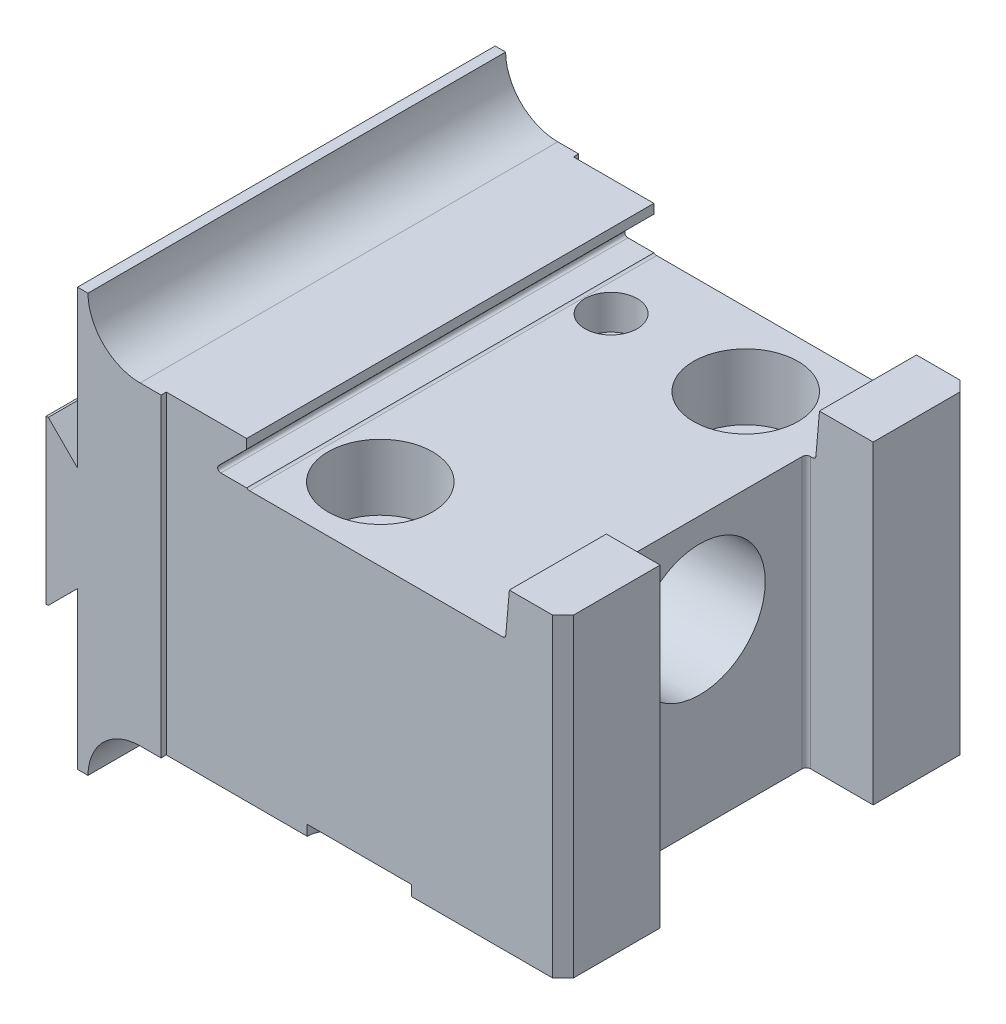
ISO-10303-21;
HEADER;
FILE_DESCRIPTION(('STEP AP214'),'2;1');
FILE_NAME('part.step','',(''),(''),'','','');
FILE_SCHEMA(('AUTOMOTIVE_DESIGN { 1 0 10303 214 1 1 1 1 }'));
ENDSEC;
DATA;
#1=APPLICATION_CONTEXT('core data for automotive mechanical design processes');
#2=APPLICATION_PROTOCOL_DEFINITION('international standard','automotive_design',2000,#1);
#3=PRODUCT_CONTEXT('',#1,'mechanical');
#4=PRODUCT('Part','Part','',(#3));
#5=PRODUCT_RELATED_PRODUCT_CATEGORY('part','',(#4));
#6=PRODUCT_DEFINITION_FORMATION('','',#4);
#7=PRODUCT_DEFINITION_CONTEXT('part definition',#1,'design');
#8=PRODUCT_DEFINITION('design','',#6,#7);
#9=PRODUCT_DEFINITION_SHAPE('','',#8);
#10=(LENGTH_UNIT() NAMED_UNIT(*) SI_UNIT(.MILLI.,.METRE.));
#11=(NAMED_UNIT(*) PLANE_ANGLE_UNIT() SI_UNIT($,.RADIAN.));
#12=(NAMED_UNIT(*) SI_UNIT($,.STERADIAN.) SOLID_ANGLE_UNIT());
#13=UNCERTAINTY_MEASURE_WITH_UNIT(LENGTH_MEASURE(1.E-05),#10,'distance_accuracy_value','');
#14=(GEOMETRIC_REPRESENTATION_CONTEXT(3) GLOBAL_UNCERTAINTY_ASSIGNED_CONTEXT((#13)) GLOBAL_UNIT_ASSIGNED_CONTEXT((#10,
#11,#12)) REPRESENTATION_CONTEXT('',''));
#15=CARTESIAN_POINT('',(0.,0.,0.));
#16=DIRECTION('',(0.,0.,1.));
#17=DIRECTION('',(1.,0.,0.));
#18=AXIS2_PLACEMENT_3D('',#15,#16,#17);
#19=CARTESIAN_POINT('',(-22.987,2.921,0.));
#20=DIRECTION('',(-1.,0.,0.));
#21=DIRECTION('',(0.,-1.,0.));
#22=AXIS2_PLACEMENT_3D('',#19,#20,#21);
#23=CYLINDRICAL_SURFACE('',#22,6.35);
#24=CARTESIAN_POINT('',(-22.987,2.921,0.));
#25=DIRECTION('',(-1.,0.,0.));
#26=DIRECTION('',(0.,-1.,0.));
#27=AXIS2_PLACEMENT_3D('',#24,#25,#26);
#28=CIRCLE('',#27,6.35);
#29=CARTESIAN_POINT('',(-22.987,-3.429,0.));
#30=VERTEX_POINT('',#29);
#31=EDGE_CURVE('E523',#30,#30,#28,.T.);
#32=ORIENTED_EDGE('',*,*,#31,.F.);
#33=EDGE_LOOP('',(#32));
#34=FACE_BOUND('',#33,.T.);
#35=CARTESIAN_POINT('',(-23.495,2.921,0.));
#36=DIRECTION('',(-1.,0.,0.));
#37=DIRECTION('',(0.,0.,1.));
#38=AXIS2_PLACEMENT_3D('',#35,#36,#37);
#39=CIRCLE('',#38,6.35);
#40=CARTESIAN_POINT('',(-23.495,2.921,6.35));
#41=VERTEX_POINT('',#40);
#42=EDGE_CURVE('E377',#41,#41,#39,.F.);
#43=ORIENTED_EDGE('',*,*,#42,.F.);
#44=EDGE_LOOP('',(#43));
#45=FACE_BOUND('',#44,.T.);
#46=ADVANCED_FACE('F36',(#34,#45),#23,.F.);
#47=CARTESIAN_POINT('',(-15.875,2.921,0.));
#48=DIRECTION('',(1.,0.,0.));
#49=DIRECTION('',(0.,0.,-1.));
#50=AXIS2_PLACEMENT_3D('',#47,#48,#49);
#51=CYLINDRICAL_SURFACE('',#50,5.0419);
#52=CARTESIAN_POINT('',(-15.875,2.921,0.));
#53=DIRECTION('',(1.,0.,0.));
#54=DIRECTION('',(0.,0.,-1.));
#55=AXIS2_PLACEMENT_3D('',#52,#53,#54);
#56=CIRCLE('',#55,5.0419);
#57=CARTESIAN_POINT('',(-15.875,2.921,-5.0419));
#58=VERTEX_POINT('',#57);
#59=EDGE_CURVE('E527',#58,#58,#56,.T.);
#60=ORIENTED_EDGE('',*,*,#59,.T.);
#61=EDGE_LOOP('',(#60));
#62=FACE_BOUND('',#61,.T.);
#63=CARTESIAN_POINT('',(-22.987,2.921,0.));
#64=DIRECTION('',(-1.,0.,0.));
#65=DIRECTION('',(0.,-1.,0.));
#66=AXIS2_PLACEMENT_3D('',#63,#64,#65);
#67=CIRCLE('',#66,5.0419);
#68=CARTESIAN_POINT('',(-22.987,-2.1209,0.));
#69=VERTEX_POINT('',#68);
#70=EDGE_CURVE('E526',#69,#69,#67,.F.);
#71=ORIENTED_EDGE('',*,*,#70,.F.);
#72=EDGE_LOOP('',(#71));
#73=FACE_BOUND('',#72,.T.);
#74=ADVANCED_FACE('F936',(#62,#73),#51,.F.);
#75=CARTESIAN_POINT('',(16.637,-19.05,12.954));
#76=DIRECTION('',(-1.,0.,0.));
#77=DIRECTION('',(0.,0.,1.));
#78=AXIS2_PLACEMENT_3D('',#75,#76,#77);
#79=PLANE('',#78);
#80=CARTESIAN_POINT('',(16.637,2.921,0.));
#81=DIRECTION('',(1.,0.,0.));
#82=DIRECTION('',(0.,0.,-1.));
#83=AXIS2_PLACEMENT_3D('',#80,#81,#82);
#84=CIRCLE('',#83,7.95655);
#85=CARTESIAN_POINT('',(16.637,2.921,-7.95655));
#86=VERTEX_POINT('',#85);
#87=EDGE_CURVE('E551',#86,#86,#84,.T.);
#88=ORIENTED_EDGE('',*,*,#87,.F.);
#89=EDGE_LOOP('',(#88));
#90=FACE_BOUND('',#89,.T.);
#91=DIRECTION('',(0.,0.,-1.));
#92=VECTOR('',#91,1.);
#93=CARTESIAN_POINT('',(16.637,13.843,12.954));
#94=LINE('',#93,#92);
#95=CARTESIAN_POINT('',(16.637,13.843,12.446));
#96=VERTEX_POINT('',#95);
#97=CARTESIAN_POINT('',(16.637,13.843,-12.446));
#98=VERTEX_POINT('',#97);
#99=EDGE_CURVE('E545',#96,#98,#94,.T.);
#100=ORIENTED_EDGE('',*,*,#99,.F.);
#101=DIRECTION('',(0.,1.,0.));
#102=VECTOR('',#101,1.);
#103=CARTESIAN_POINT('',(16.637,-19.05,12.446));
#104=LINE('',#103,#102);
#105=CARTESIAN_POINT('',(16.637,-19.05,12.446));
#106=VERTEX_POINT('',#105);
#107=EDGE_CURVE('E680',#96,#106,#104,.F.);
#108=ORIENTED_EDGE('',*,*,#107,.T.);
#109=DIRECTION('',(0.,0.,1.));
#110=VECTOR('',#109,1.);
#111=CARTESIAN_POINT('',(16.637,-19.05,12.954));
#112=LINE('',#111,#110);
#113=CARTESIAN_POINT('',(16.637,-19.05,-12.446));
#114=VERTEX_POINT('',#113);
#115=EDGE_CURVE('E555',#114,#106,#112,.T.);
#116=ORIENTED_EDGE('',*,*,#115,.F.);
#117=DIRECTION('',(0.,1.,0.));
#118=VECTOR('',#117,1.);
#119=CARTESIAN_POINT('',(16.637,13.843,-12.446));
#120=LINE('',#119,#118);
#121=EDGE_CURVE('E677',#114,#98,#120,.T.);
#122=ORIENTED_EDGE('',*,*,#121,.T.);
#123=EDGE_LOOP('',(#100,#108,#116,#122));
#124=FACE_BOUND('',#123,.T.);
#125=ADVANCED_FACE('F707',(#90,#124),#79,.F.);
#126=CARTESIAN_POINT('',(17.78,13.97,-24.765));
#127=DIRECTION('',(-0.996194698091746,0.0871557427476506,0.));
#128=DIRECTION('',(-0.0871557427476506,-0.996194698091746,0.));
#129=AXIS2_PLACEMENT_3D('',#126,#127,#128);
#130=PLANE('',#129);
#131=DIRECTION('',(-0.0871557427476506,-0.996194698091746,0.));
#132=VECTOR('',#131,1.);
#133=CARTESIAN_POINT('',(17.78,13.97,-24.765));
#134=LINE('',#133,#132);
#135=CARTESIAN_POINT('',(18.2244424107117,19.05,-24.765));
#136=VERTEX_POINT('',#135);
#137=CARTESIAN_POINT('',(17.7993169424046,14.1907936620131,-24.765));
#138=VERTEX_POINT('',#137);
#139=EDGE_CURVE('E591',#136,#138,#134,.T.);
#140=ORIENTED_EDGE('',*,*,#139,.T.);
#141=DIRECTION('',(0.,0.,-1.));
#142=VECTOR('',#141,1.);
#143=CARTESIAN_POINT('',(17.7993169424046,14.1907936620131,-12.954));
#144=LINE('',#143,#142);
#145=CARTESIAN_POINT('',(17.7993169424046,14.1907936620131,-12.954));
#146=VERTEX_POINT('',#145);
#147=EDGE_CURVE('E651',#138,#146,#144,.F.);
#148=ORIENTED_EDGE('',*,*,#147,.T.);
#149=DIRECTION('',(-0.0871557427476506,-0.996194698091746,0.));
#150=VECTOR('',#149,1.);
#151=CARTESIAN_POINT('',(17.78,13.97,-12.954));
#152=LINE('',#151,#150);
#153=CARTESIAN_POINT('',(18.2244424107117,19.05,-12.954));
#154=VERTEX_POINT('',#153);
#155=EDGE_CURVE('E570',#154,#146,#152,.T.);
#156=ORIENTED_EDGE('',*,*,#155,.F.);
#157=DIRECTION('',(0.,0.,1.));
#158=VECTOR('',#157,1.);
#159=CARTESIAN_POINT('',(18.2244424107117,19.05,-24.765));
#160=LINE('',#159,#158);
#161=EDGE_CURVE('E606',#136,#154,#160,.T.);
#162=ORIENTED_EDGE('',*,*,#161,.F.);
#163=EDGE_LOOP('',(#140,#148,#156,#162));
#164=FACE_BOUND('',#163,.T.);
#165=ADVANCED_FACE('F730',(#164),#130,.T.);
#166=CARTESIAN_POINT('',(24.765,-19.05,-24.765));
#167=DIRECTION('',(1.,0.,0.));
#168=DIRECTION('',(0.,0.,-1.));
#169=AXIS2_PLACEMENT_3D('',#166,#167,#168);
#170=PLANE('',#169);
#171=DIRECTION('',(0.,0.,1.));
#172=VECTOR('',#171,1.);
#173=CARTESIAN_POINT('',(24.765,-19.05,-24.765));
#174=LINE('',#173,#172);
#175=CARTESIAN_POINT('',(24.765,-19.05,-23.495));
#176=VERTEX_POINT('',#175);
#177=CARTESIAN_POINT('',(24.765,-19.05,-12.954));
#178=VERTEX_POINT('',#177);
#179=EDGE_CURVE('E610',#176,#178,#174,.T.);
#180=ORIENTED_EDGE('',*,*,#179,.F.);
#181=DIRECTION('',(0.,1.,0.));
#182=VECTOR('',#181,1.);
#183=CARTESIAN_POINT('',(24.765,19.05,-23.495));
#184=LINE('',#183,#182);
#185=CARTESIAN_POINT('',(24.765,19.177,-23.495));
#186=VERTEX_POINT('',#185);
#187=EDGE_CURVE('E638',#176,#186,#184,.T.);
#188=ORIENTED_EDGE('',*,*,#187,.T.);
#189=DIRECTION('',(0.,0.,-1.));
#190=VECTOR('',#189,1.);
#191=CARTESIAN_POINT('',(24.765,19.177,-12.954));
#192=LINE('',#191,#190);
#193=CARTESIAN_POINT('',(24.765,19.177,-12.954));
#194=VERTEX_POINT('',#193);
#195=EDGE_CURVE('E401',#194,#186,#192,.T.);
#196=ORIENTED_EDGE('',*,*,#195,.F.);
#197=DIRECTION('',(0.,1.,0.));
#198=VECTOR('',#197,1.);
#199=CARTESIAN_POINT('',(24.765,-19.05,-12.954));
#200=LINE('',#199,#198);
#201=EDGE_CURVE('E565',#178,#194,#200,.T.);
#202=ORIENTED_EDGE('',*,*,#201,.F.);
#203=EDGE_LOOP('',(#180,#188,#196,#202));
#204=FACE_BOUND('',#203,.T.);
#205=ADVANCED_FACE('F717',(#204),#170,.T.);
#206=CARTESIAN_POINT('',(-13.716,19.05,-24.765));
#207=DIRECTION('',(1.,0.,0.));
#208=DIRECTION('',(0.,0.,-1.));
#209=AXIS2_PLACEMENT_3D('',#206,#207,#208);
#210=PLANE('',#209);
#211=DIRECTION('',(0.,1.,0.));
#212=VECTOR('',#211,1.);
#213=CARTESIAN_POINT('',(-13.716,19.05,-24.765));
#214=LINE('',#213,#212);
#215=CARTESIAN_POINT('',(-13.716,18.034,-24.765));
#216=VERTEX_POINT('',#215);
#217=CARTESIAN_POINT('',(-13.716,19.177,-24.765));
#218=VERTEX_POINT('',#217);
#219=EDGE_CURVE('E599',#216,#218,#214,.T.);
#220=ORIENTED_EDGE('',*,*,#219,.T.);
#221=DIRECTION('',(0.,0.,-1.));
#222=VECTOR('',#221,1.);
#223=CARTESIAN_POINT('',(-13.716,19.177,24.765));
#224=LINE('',#223,#222);
#225=CARTESIAN_POINT('',(-13.716,19.177,24.765));
#226=VERTEX_POINT('',#225);
#227=EDGE_CURVE('E420',#226,#218,#224,.T.);
#228=ORIENTED_EDGE('',*,*,#227,.F.);
#229=DIRECTION('',(0.,1.,0.));
#230=VECTOR('',#229,1.);
#231=CARTESIAN_POINT('',(-13.716,19.05,24.765));
#232=LINE('',#231,#230);
#233=CARTESIAN_POINT('',(-13.716,18.034,24.765));
#234=VERTEX_POINT('',#233);
#235=EDGE_CURVE('E585',#234,#226,#232,.T.);
#236=ORIENTED_EDGE('',*,*,#235,.F.);
#237=DIRECTION('',(0.,0.,1.));
#238=VECTOR('',#237,1.);
#239=CARTESIAN_POINT('',(-13.716,18.034,-24.765));
#240=LINE('',#239,#238);
#241=EDGE_CURVE('E602',#216,#234,#240,.T.);
#242=ORIENTED_EDGE('',*,*,#241,.F.);
#243=EDGE_LOOP('',(#220,#228,#236,#242));
#244=FACE_BOUND('',#243,.T.);
#245=ADVANCED_FACE('F766',(#244),#210,.T.);
#246=CARTESIAN_POINT('',(-17.7800000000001,13.97,-24.765));
#247=DIRECTION('',(0.707106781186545,-0.70710678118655,0.));
#248=DIRECTION('',(0.70710678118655,0.707106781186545,0.));
#249=AXIS2_PLACEMENT_3D('',#246,#247,#248);
#250=PLANE('',#249);
#251=DIRECTION('',(0.70710678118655,0.707106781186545,0.));
#252=VECTOR('',#251,1.);
#253=CARTESIAN_POINT('',(-17.7800000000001,13.97,24.765));
#254=LINE('',#253,#252);
#255=CARTESIAN_POINT('',(-17.129592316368,14.6204076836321,24.765));
#256=VERTEX_POINT('',#255);
#257=EDGE_CURVE('E583',#256,#234,#254,.T.);
#258=ORIENTED_EDGE('',*,*,#257,.F.);
#259=DIRECTION('',(0.,0.,1.));
#260=VECTOR('',#259,1.);
#261=CARTESIAN_POINT('',(-17.129592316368,14.6204076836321,-24.765));
#262=LINE('',#261,#260);
#263=CARTESIAN_POINT('',(-17.129592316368,14.6204076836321,-24.765));
#264=VERTEX_POINT('',#263);
#265=EDGE_CURVE('E643',#256,#264,#262,.F.);
#266=ORIENTED_EDGE('',*,*,#265,.T.);
#267=DIRECTION('',(0.70710678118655,0.707106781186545,0.));
#268=VECTOR('',#267,1.);
#269=CARTESIAN_POINT('',(-17.7800000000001,13.97,-24.765));
#270=LINE('',#269,#268);
#271=EDGE_CURVE('E597',#264,#216,#270,.T.);
#272=ORIENTED_EDGE('',*,*,#271,.T.);
#273=ORIENTED_EDGE('',*,*,#241,.T.);
#274=EDGE_LOOP('',(#258,#266,#272,#273));
#275=FACE_BOUND('',#274,.T.);
#276=ADVANCED_FACE('F759',(#275),#250,.T.);
#277=CARTESIAN_POINT('',(17.78,13.97,-24.765));
#278=DIRECTION('',(0.,1.,0.));
#279=DIRECTION('',(-1.,0.,0.));
#280=AXIS2_PLACEMENT_3D('',#277,#278,#279);
#281=PLANE('',#280);
#282=DIRECTION('',(-1.,0.,0.));
#283=VECTOR('',#282,1.);
#284=CARTESIAN_POINT('',(17.78,13.97,-24.765));
#285=LINE('',#284,#283);
#286=CARTESIAN_POINT('',(-13.716,13.97,-24.765));
#287=VERTEX_POINT('',#286);
#288=CARTESIAN_POINT('',(-16.8601846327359,13.97,-24.765));
#289=VERTEX_POINT('',#288);
#290=EDGE_CURVE('E594',#287,#289,#285,.T.);
#291=ORIENTED_EDGE('',*,*,#290,.T.);
#292=DIRECTION('',(0.,0.,1.));
#293=VECTOR('',#292,1.);
#294=CARTESIAN_POINT('',(-16.8601846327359,13.97,24.765));
#295=LINE('',#294,#293);
#296=CARTESIAN_POINT('',(-16.8601846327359,13.97,24.765));
#297=VERTEX_POINT('',#296);
#298=EDGE_CURVE('E640',#289,#297,#295,.T.);
#299=ORIENTED_EDGE('',*,*,#298,.T.);
#300=DIRECTION('',(-1.,0.,0.));
#301=VECTOR('',#300,1.);
#302=CARTESIAN_POINT('',(17.78,13.97,24.765));
#303=LINE('',#302,#301);
#304=CARTESIAN_POINT('',(-13.716,13.97,24.765));
#305=VERTEX_POINT('',#304);
#306=EDGE_CURVE('E580',#305,#297,#303,.T.);
#307=ORIENTED_EDGE('',*,*,#306,.F.);
#308=DIRECTION('',(0.,0.,1.));
#309=VECTOR('',#308,1.);
#310=CARTESIAN_POINT('',(-13.716,13.97,-24.765));
#311=LINE('',#310,#309);
#312=EDGE_CURVE('E537',#287,#305,#311,.T.);
#313=ORIENTED_EDGE('',*,*,#312,.F.);
#314=EDGE_LOOP('',(#291,#299,#307,#313));
#315=FACE_BOUND('',#314,.T.);
#316=ADVANCED_FACE('F750',(#315),#281,.T.);
#317=DIRECTION('',(0.0871557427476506,0.996194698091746,0.));
#318=VECTOR('',#317,1.);
#319=CARTESIAN_POINT('',(17.78,13.97,12.954));
#320=LINE('',#319,#318);
#321=CARTESIAN_POINT('',(17.7993169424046,14.1907936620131,12.954));
#322=VERTEX_POINT('',#321);
#323=CARTESIAN_POINT('',(18.2244424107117,19.05,12.954));
#324=VERTEX_POINT('',#323);
#325=EDGE_CURVE('E567',#322,#324,#320,.T.);
#326=ORIENTED_EDGE('',*,*,#325,.F.);
#327=DIRECTION('',(0.,0.,-1.));
#328=VECTOR('',#327,1.);
#329=CARTESIAN_POINT('',(17.7993169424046,14.1907936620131,24.765));
#330=LINE('',#329,#328);
#331=CARTESIAN_POINT('',(17.7993169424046,14.1907936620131,24.765));
#332=VERTEX_POINT('',#331);
#333=EDGE_CURVE('E653',#322,#332,#330,.F.);
#334=ORIENTED_EDGE('',*,*,#333,.T.);
#335=DIRECTION('',(-0.0871557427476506,-0.996194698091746,0.));
#336=VECTOR('',#335,1.);
#337=CARTESIAN_POINT('',(17.78,13.97,24.765));
#338=LINE('',#337,#336);
#339=CARTESIAN_POINT('',(18.2244424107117,19.05,24.765));
#340=VERTEX_POINT('',#339);
#341=EDGE_CURVE('E577',#340,#332,#338,.T.);
#342=ORIENTED_EDGE('',*,*,#341,.F.);
#343=EDGE_CURVE('E609',#324,#340,#160,.T.);
#344=ORIENTED_EDGE('',*,*,#343,.F.);
#345=EDGE_LOOP('',(#326,#334,#342,#344));
#346=FACE_BOUND('',#345,.T.);
#347=ADVANCED_FACE('F925',(#346),#130,.T.);
#348=DIRECTION('',(0.,1.,0.));
#349=VECTOR('',#348,1.);
#350=CARTESIAN_POINT('',(24.765,-19.05,12.954));
#351=LINE('',#350,#349);
#352=CARTESIAN_POINT('',(24.765,-19.05,12.954));
#353=VERTEX_POINT('',#352);
#354=CARTESIAN_POINT('',(24.765,19.177,12.954));
#355=VERTEX_POINT('',#354);
#356=EDGE_CURVE('E564',#353,#355,#351,.T.);
#357=ORIENTED_EDGE('',*,*,#356,.T.);
#358=DIRECTION('',(0.,0.,-1.));
#359=VECTOR('',#358,1.);
#360=CARTESIAN_POINT('',(24.765,19.177,23.495));
#361=LINE('',#360,#359);
#362=CARTESIAN_POINT('',(24.765,19.177,23.495));
#363=VERTEX_POINT('',#362);
#364=EDGE_CURVE('E387',#363,#355,#361,.T.);
#365=ORIENTED_EDGE('',*,*,#364,.F.);
#366=DIRECTION('',(0.,-1.,0.));
#367=VECTOR('',#366,1.);
#368=CARTESIAN_POINT('',(24.765,-19.05,23.495));
#369=LINE('',#368,#367);
#370=CARTESIAN_POINT('',(24.765,-19.05,23.495));
#371=VERTEX_POINT('',#370);
#372=EDGE_CURVE('E625',#363,#371,#369,.T.);
#373=ORIENTED_EDGE('',*,*,#372,.T.);
#374=EDGE_CURVE('E601',#353,#371,#174,.T.);
#375=ORIENTED_EDGE('',*,*,#374,.F.);
#376=EDGE_LOOP('',(#357,#365,#373,#375));
#377=FACE_BOUND('',#376,.T.);
#378=ADVANCED_FACE('F912',(#377),#170,.T.);
#379=CARTESIAN_POINT('',(-24.765,-19.05,-24.765));
#380=DIRECTION('',(0.,-1.,0.));
#381=DIRECTION('',(1.,0.,0.));
#382=AXIS2_PLACEMENT_3D('',#379,#380,#381);
#383=PLANE('',#382);
#384=DIRECTION('',(0.,0.,-1.));
#385=VECTOR('',#384,1.);
#386=CARTESIAN_POINT('',(-23.495,-19.05,25.4));
#387=LINE('',#386,#385);
#388=CARTESIAN_POINT('',(-23.495,-19.05,-24.7649999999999));
#389=VERTEX_POINT('',#388);
#390=CARTESIAN_POINT('',(-23.495,-19.05,-25.4));
#391=VERTEX_POINT('',#390);
#392=EDGE_CURVE('E779',#389,#391,#387,.T.);
#393=ORIENTED_EDGE('',*,*,#392,.F.);
#394=DIRECTION('',(1.,0.,0.));
#395=VECTOR('',#394,1.);
#396=CARTESIAN_POINT('',(-24.765,-19.05,-24.765));
#397=LINE('',#396,#395);
#398=CARTESIAN_POINT('',(-6.35000000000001,-19.05,-24.765));
#399=VERTEX_POINT('',#398);
#400=EDGE_CURVE('E588',#389,#399,#397,.T.);
#401=ORIENTED_EDGE('',*,*,#400,.T.);
#402=CARTESIAN_POINT('',(-3.81000000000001,-19.05,-24.765));
#403=DIRECTION('',(0.,-1.,0.));
#404=DIRECTION('',(-1.,0.,0.));
#405=AXIS2_PLACEMENT_3D('',#402,#403,#404);
#406=CIRCLE('',#405,2.54);
#407=CARTESIAN_POINT('',(-3.81000000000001,-19.05,-22.225));
#408=VERTEX_POINT('',#407);
#409=EDGE_CURVE('E435',#408,#399,#406,.T.);
#410=ORIENTED_EDGE('',*,*,#409,.F.);
#411=DIRECTION('',(-1.,0.,0.));
#412=VECTOR('',#411,1.);
#413=CARTESIAN_POINT('',(-3.81000000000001,-19.05,-22.225));
#414=LINE('',#413,#412);
#415=CARTESIAN_POINT('',(3.80999999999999,-19.05,-22.225));
#416=VERTEX_POINT('',#415);
#417=EDGE_CURVE('E439',#416,#408,#414,.T.);
#418=ORIENTED_EDGE('',*,*,#417,.F.);
#419=CARTESIAN_POINT('',(3.80999999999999,-19.05,-24.765));
#420=DIRECTION('',(0.,-1.,0.));
#421=DIRECTION('',(1.,0.,0.));
#422=AXIS2_PLACEMENT_3D('',#419,#420,#421);
#423=CIRCLE('',#422,2.54);
#424=CARTESIAN_POINT('',(6.34999999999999,-19.05,-24.765));
#425=VERTEX_POINT('',#424);
#426=EDGE_CURVE('E450',#425,#416,#423,.T.);
#427=ORIENTED_EDGE('',*,*,#426,.F.);
#428=CARTESIAN_POINT('',(23.495,-19.05,-24.765));
#429=VERTEX_POINT('',#428);
#430=EDGE_CURVE('E587',#425,#429,#397,.T.);
#431=ORIENTED_EDGE('',*,*,#430,.T.);
#432=DIRECTION('',(0.707106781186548,0.,0.707106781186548));
#433=VECTOR('',#432,1.);
#434=CARTESIAN_POINT('',(-0.635000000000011,-19.05,-48.895));
#435=LINE('',#434,#433);
#436=EDGE_CURVE('E627',#429,#176,#435,.T.);
#437=ORIENTED_EDGE('',*,*,#436,.T.);
#438=ORIENTED_EDGE('',*,*,#179,.T.);
#439=DIRECTION('',(-1.,0.,0.));
#440=VECTOR('',#439,1.);
#441=CARTESIAN_POINT('',(16.637,-19.05,-12.954));
#442=LINE('',#441,#440);
#443=CARTESIAN_POINT('',(17.145,-19.05,-12.954));
#444=VERTEX_POINT('',#443);
#445=EDGE_CURVE('E562',#178,#444,#442,.T.);
#446=ORIENTED_EDGE('',*,*,#445,.T.);
#447=CARTESIAN_POINT('',(17.145,-19.05,-12.446));
#448=DIRECTION('',(0.,-1.,0.));
#449=DIRECTION('',(1.,0.,0.));
#450=AXIS2_PLACEMENT_3D('',#447,#448,#449);
#451=CIRCLE('',#450,0.508);
#452=EDGE_CURVE('E11',#444,#114,#451,.F.);
#453=ORIENTED_EDGE('',*,*,#452,.T.);
#454=ORIENTED_EDGE('',*,*,#115,.T.);
#455=CARTESIAN_POINT('',(17.145,-19.05,12.446));
#456=DIRECTION('',(0.,-1.,0.));
#457=DIRECTION('',(1.,0.,0.));
#458=AXIS2_PLACEMENT_3D('',#455,#456,#457);
#459=CIRCLE('',#458,0.508);
#460=CARTESIAN_POINT('',(17.145,-19.05,12.954));
#461=VERTEX_POINT('',#460);
#462=EDGE_CURVE('E685',#106,#461,#459,.F.);
#463=ORIENTED_EDGE('',*,*,#462,.T.);
#464=DIRECTION('',(1.,0.,0.));
#465=VECTOR('',#464,1.);
#466=CARTESIAN_POINT('',(16.637,-19.05,12.954));
#467=LINE('',#466,#465);
#468=EDGE_CURVE('E560',#461,#353,#467,.T.);
#469=ORIENTED_EDGE('',*,*,#468,.T.);
#470=ORIENTED_EDGE('',*,*,#374,.T.);
#471=DIRECTION('',(0.707106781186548,0.,-0.707106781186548));
#472=VECTOR('',#471,1.);
#473=CARTESIAN_POINT('',(24.13,-19.05,24.13));
#474=LINE('',#473,#472);
#475=CARTESIAN_POINT('',(23.495,-19.05,24.765));
#476=VERTEX_POINT('',#475);
#477=EDGE_CURVE('E629',#371,#476,#474,.F.);
#478=ORIENTED_EDGE('',*,*,#477,.T.);
#479=DIRECTION('',(1.,0.,0.));
#480=VECTOR('',#479,1.);
#481=CARTESIAN_POINT('',(-24.765,-19.05,24.765));
#482=LINE('',#481,#480);
#483=CARTESIAN_POINT('',(6.35,-19.05,24.765));
#484=VERTEX_POINT('',#483);
#485=EDGE_CURVE('E573',#484,#476,#482,.T.);
#486=ORIENTED_EDGE('',*,*,#485,.F.);
#487=CARTESIAN_POINT('',(3.81,-19.05,24.765));
#488=DIRECTION('',(0.,-1.,0.));
#489=DIRECTION('',(-1.,0.,0.));
#490=AXIS2_PLACEMENT_3D('',#487,#488,#489);
#491=CIRCLE('',#490,2.54);
#492=CARTESIAN_POINT('',(3.81,-19.05,22.225));
#493=VERTEX_POINT('',#492);
#494=EDGE_CURVE('E468',#493,#484,#491,.T.);
#495=ORIENTED_EDGE('',*,*,#494,.F.);
#496=DIRECTION('',(1.,0.,0.));
#497=VECTOR('',#496,1.);
#498=CARTESIAN_POINT('',(-3.81,-19.05,22.225));
#499=LINE('',#498,#497);
#500=CARTESIAN_POINT('',(-3.81,-19.05,22.225));
#501=VERTEX_POINT('',#500);
#502=EDGE_CURVE('E479',#501,#493,#499,.T.);
#503=ORIENTED_EDGE('',*,*,#502,.F.);
#504=CARTESIAN_POINT('',(-3.81,-19.05,24.765));
#505=DIRECTION('',(0.,-1.,0.));
#506=DIRECTION('',(1.,0.,0.));
#507=AXIS2_PLACEMENT_3D('',#504,#505,#506);
#508=CIRCLE('',#507,2.54);
#509=CARTESIAN_POINT('',(-6.35,-19.05,24.765));
#510=VERTEX_POINT('',#509);
#511=EDGE_CURVE('E457',#510,#501,#508,.T.);
#512=ORIENTED_EDGE('',*,*,#511,.F.);
#513=CARTESIAN_POINT('',(-23.495,-19.05,24.765));
#514=VERTEX_POINT('',#513);
#515=EDGE_CURVE('E574',#514,#510,#482,.T.);
#516=ORIENTED_EDGE('',*,*,#515,.F.);
#517=CARTESIAN_POINT('',(-23.495,-19.05,25.4));
#518=VERTEX_POINT('',#517);
#519=EDGE_CURVE('E782',#518,#514,#387,.T.);
#520=ORIENTED_EDGE('',*,*,#519,.F.);
#521=DIRECTION('',(1.,0.,0.));
#522=VECTOR('',#521,1.);
#523=CARTESIAN_POINT('',(-26.0353175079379,-19.05,25.4));
#524=LINE('',#523,#522);
#525=CARTESIAN_POINT('',(-26.0353175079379,-19.05,25.4));
#526=VERTEX_POINT('',#525);
#527=EDGE_CURVE('E880',#526,#518,#524,.T.);
#528=ORIENTED_EDGE('',*,*,#527,.F.);
#529=DIRECTION('',(0.,0.,-1.));
#530=VECTOR('',#529,1.);
#531=CARTESIAN_POINT('',(-26.0353175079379,-19.05,25.4));
#532=LINE('',#531,#530);
#533=CARTESIAN_POINT('',(-26.0353175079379,-19.05,-25.4));
#534=VERTEX_POINT('',#533);
#535=EDGE_CURVE('E788',#526,#534,#532,.T.);
#536=ORIENTED_EDGE('',*,*,#535,.T.);
#537=DIRECTION('',(1.,0.,0.));
#538=VECTOR('',#537,1.);
#539=CARTESIAN_POINT('',(-26.0353175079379,-19.05,-25.4));
#540=LINE('',#539,#538);
#541=EDGE_CURVE('E836',#534,#391,#540,.T.);
#542=ORIENTED_EDGE('',*,*,#541,.T.);
#543=EDGE_LOOP('',(#393,#401,#410,#418,#427,#431,#437,#438,#446,#453,#454,#463,#469,#470,#478,
#486,#495,#503,#512,#516,#520,#528,#536,#542));
#544=FACE_BOUND('',#543,.T.);
#545=CARTESIAN_POINT('',(-6.35000000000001,-19.05,15.875));
#546=DIRECTION('',(0.,1.,0.));
#547=DIRECTION('',(0.,0.,1.));
#548=AXIS2_PLACEMENT_3D('',#545,#546,#547);
#549=CIRCLE('',#548,4.25449999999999);
#550=CARTESIAN_POINT('',(-6.35000000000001,-19.05,20.1295));
#551=VERTEX_POINT('',#550);
#552=EDGE_CURVE('E519',#551,#551,#549,.T.);
#553=ORIENTED_EDGE('',*,*,#552,.T.);
#554=EDGE_LOOP('',(#553));
#555=FACE_BOUND('',#554,.T.);
#556=CARTESIAN_POINT('',(6.35,-19.05,-15.875));
#557=DIRECTION('',(0.,1.,0.));
#558=DIRECTION('',(0.,0.,1.));
#559=AXIS2_PLACEMENT_3D('',#556,#557,#558);
#560=CIRCLE('',#559,4.25449999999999);
#561=CARTESIAN_POINT('',(6.35,-19.05,-11.6205));
#562=VERTEX_POINT('',#561);
#563=EDGE_CURVE('E509',#562,#562,#560,.T.);
#564=ORIENTED_EDGE('',*,*,#563,.T.);
#565=EDGE_LOOP('',(#564));
#566=FACE_BOUND('',#565,.T.);
#567=CARTESIAN_POINT('',(-10.033,-19.05,-15.875));
#568=DIRECTION('',(0.,-1.,0.));
#569=DIRECTION('',(0.,0.,-1.));
#570=AXIS2_PLACEMENT_3D('',#567,#568,#569);
#571=CIRCLE('',#570,4.76631);
#572=CARTESIAN_POINT('',(-10.033,-19.05,-20.64131));
#573=VERTEX_POINT('',#572);
#574=EDGE_CURVE('E497',#573,#573,#571,.T.);
#575=ORIENTED_EDGE('',*,*,#574,.F.);
#576=EDGE_LOOP('',(#575));
#577=FACE_BOUND('',#576,.T.);
#578=CARTESIAN_POINT('',(10.033,-19.05,15.875));
#579=DIRECTION('',(0.,-1.,0.));
#580=DIRECTION('',(0.,0.,-1.));
#581=AXIS2_PLACEMENT_3D('',#578,#579,#580);
#582=CIRCLE('',#581,4.76631);
#583=CARTESIAN_POINT('',(10.033,-19.05,11.10869));
#584=VERTEX_POINT('',#583);
#585=EDGE_CURVE('E485',#584,#584,#582,.T.);
#586=ORIENTED_EDGE('',*,*,#585,.F.);
#587=EDGE_LOOP('',(#586));
#588=FACE_BOUND('',#587,.T.);
#589=ADVANCED_FACE('F690',(#544,#555,#566,#577,#588),#383,.T.);
#590=CARTESIAN_POINT('',(-24.765,-19.05,-24.765));
#591=DIRECTION('',(0.,0.,1.));
#592=DIRECTION('',(1.,0.,0.));
#593=AXIS2_PLACEMENT_3D('',#590,#591,#592);
#594=PLANE('',#593);
#595=DIRECTION('',(1.,0.,0.));
#596=VECTOR('',#595,1.);
#597=CARTESIAN_POINT('',(-6.35000000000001,-17.78,-24.765));
#598=LINE('',#597,#596);
#599=CARTESIAN_POINT('',(-6.35000000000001,-17.78,-24.765));
#600=VERTEX_POINT('',#599);
#601=CARTESIAN_POINT('',(6.34999999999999,-17.78,-24.765));
#602=VERTEX_POINT('',#601);
#603=EDGE_CURVE('E438',#600,#602,#598,.T.);
#604=ORIENTED_EDGE('',*,*,#603,.F.);
#605=DIRECTION('',(0.,-1.,0.));
#606=VECTOR('',#605,1.);
#607=CARTESIAN_POINT('',(-6.35000000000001,-17.78,-24.765));
#608=LINE('',#607,#606);
#609=EDGE_CURVE('E448',#600,#399,#608,.T.);
#610=ORIENTED_EDGE('',*,*,#609,.T.);
#611=ORIENTED_EDGE('',*,*,#400,.F.);
#612=DIRECTION('',(0.,1.,0.));
#613=VECTOR('',#612,1.);
#614=CARTESIAN_POINT('',(-23.495,19.05,-24.765));
#615=LINE('',#614,#613);
#616=CARTESIAN_POINT('',(-23.495,19.177,-24.765));
#617=VERTEX_POINT('',#616);
#618=EDGE_CURVE('E635',#389,#617,#615,.T.);
#619=ORIENTED_EDGE('',*,*,#618,.T.);
#620=DIRECTION('',(-1.,0.,0.));
#621=VECTOR('',#620,1.);
#622=CARTESIAN_POINT('',(-13.716,19.177,-24.765));
#623=LINE('',#622,#621);
#624=EDGE_CURVE('E423',#218,#617,#623,.T.);
#625=ORIENTED_EDGE('',*,*,#624,.F.);
#626=ORIENTED_EDGE('',*,*,#219,.F.);
#627=ORIENTED_EDGE('',*,*,#271,.F.);
#628=CARTESIAN_POINT('',(-16.8601846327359,14.351,-24.765));
#629=DIRECTION('',(0.,0.,1.));
#630=DIRECTION('',(1.,0.,0.));
#631=AXIS2_PLACEMENT_3D('',#628,#629,#630);
#632=CIRCLE('',#631,0.381);
#633=EDGE_CURVE('E657',#264,#289,#632,.T.);
#634=ORIENTED_EDGE('',*,*,#633,.T.);
#635=ORIENTED_EDGE('',*,*,#290,.F.);
#636=CARTESIAN_POINT('',(-13.3799895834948,14.351,-24.765));
#637=DIRECTION('',(0.,0.,1.));
#638=DIRECTION('',(1.,0.,0.));
#639=AXIS2_PLACEMENT_3D('',#636,#637,#638);
#640=CIRCLE('',#639,0.508);
#641=CARTESIAN_POINT('',(-13.3799895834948,13.843,-24.765));
#642=VERTEX_POINT('',#641);
#643=EDGE_CURVE('E380',#287,#642,#640,.T.);
#644=ORIENTED_EDGE('',*,*,#643,.T.);
#645=DIRECTION('',(-1.,0.,0.));
#646=VECTOR('',#645,1.);
#647=CARTESIAN_POINT('',(-13.716,13.843,-24.765));
#648=LINE('',#647,#646);
#649=CARTESIAN_POINT('',(17.4197667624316,13.843,-24.765));
#650=VERTEX_POINT('',#649);
#651=EDGE_CURVE('E542',#650,#642,#648,.T.);
#652=ORIENTED_EDGE('',*,*,#651,.F.);
#653=CARTESIAN_POINT('',(17.4197667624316,14.224,-24.765));
#654=DIRECTION('',(0.,0.,1.));
#655=DIRECTION('',(1.,0.,0.));
#656=AXIS2_PLACEMENT_3D('',#653,#654,#655);
#657=CIRCLE('',#656,0.381);
#658=EDGE_CURVE('E659',#650,#138,#657,.T.);
#659=ORIENTED_EDGE('',*,*,#658,.T.);
#660=ORIENTED_EDGE('',*,*,#139,.F.);
#661=DIRECTION('',(0.,-1.,0.));
#662=VECTOR('',#661,1.);
#663=CARTESIAN_POINT('',(18.2244424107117,19.177,-24.765));
#664=LINE('',#663,#662);
#665=CARTESIAN_POINT('',(18.2244424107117,19.177,-24.765));
#666=VERTEX_POINT('',#665);
#667=EDGE_CURVE('E414',#666,#136,#664,.T.);
#668=ORIENTED_EDGE('',*,*,#667,.F.);
#669=DIRECTION('',(-1.,0.,0.));
#670=VECTOR('',#669,1.);
#671=CARTESIAN_POINT('',(23.495,19.177,-24.765));
#672=LINE('',#671,#670);
#673=CARTESIAN_POINT('',(23.495,19.177,-24.765));
#674=VERTEX_POINT('',#673);
#675=EDGE_CURVE('E407',#674,#666,#672,.T.);
#676=ORIENTED_EDGE('',*,*,#675,.F.);
#677=DIRECTION('',(0.,-1.,0.));
#678=VECTOR('',#677,1.);
#679=CARTESIAN_POINT('',(23.495,-19.05,-24.765));
#680=LINE('',#679,#678);
#681=EDGE_CURVE('E632',#674,#429,#680,.T.);
#682=ORIENTED_EDGE('',*,*,#681,.T.);
#683=ORIENTED_EDGE('',*,*,#430,.F.);
#684=DIRECTION('',(0.,-1.,0.));
#685=VECTOR('',#684,1.);
#686=CARTESIAN_POINT('',(6.34999999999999,-17.78,-24.765));
#687=LINE('',#686,#685);
#688=EDGE_CURVE('E460',#602,#425,#687,.T.);
#689=ORIENTED_EDGE('',*,*,#688,.F.);
#690=EDGE_LOOP('',(#604,#610,#611,#619,#625,#626,#627,#634,#635,#644,#652,#659,#660,#668,#676,
#682,#683,#689));
#691=FACE_BOUND('',#690,.T.);
#692=ADVANCED_FACE('F734',(#691),#594,.F.);
#693=CARTESIAN_POINT('',(-24.765,-19.05,24.765));
#694=DIRECTION('',(0.,0.,1.));
#695=DIRECTION('',(1.,0.,0.));
#696=AXIS2_PLACEMENT_3D('',#693,#694,#695);
#697=PLANE('',#696);
#698=DIRECTION('',(0.,-1.,0.));
#699=VECTOR('',#698,1.);
#700=CARTESIAN_POINT('',(-6.35,-17.78,24.765));
#701=LINE('',#700,#699);
#702=CARTESIAN_POINT('',(-6.35,-17.78,24.765));
#703=VERTEX_POINT('',#702);
#704=EDGE_CURVE('E483',#703,#510,#701,.T.);
#705=ORIENTED_EDGE('',*,*,#704,.F.);
#706=DIRECTION('',(-1.,0.,0.));
#707=VECTOR('',#706,1.);
#708=CARTESIAN_POINT('',(-6.35,-17.78,24.765));
#709=LINE('',#708,#707);
#710=CARTESIAN_POINT('',(6.35,-17.78,24.765));
#711=VERTEX_POINT('',#710);
#712=EDGE_CURVE('E473',#711,#703,#709,.T.);
#713=ORIENTED_EDGE('',*,*,#712,.F.);
#714=DIRECTION('',(0.,-1.,0.));
#715=VECTOR('',#714,1.);
#716=CARTESIAN_POINT('',(6.35,-17.78,24.765));
#717=LINE('',#716,#715);
#718=EDGE_CURVE('E486',#711,#484,#717,.T.);
#719=ORIENTED_EDGE('',*,*,#718,.T.);
#720=ORIENTED_EDGE('',*,*,#485,.T.);
#721=DIRECTION('',(0.,1.,0.));
#722=VECTOR('',#721,1.);
#723=CARTESIAN_POINT('',(23.495,-19.05,24.765));
#724=LINE('',#723,#722);
#725=CARTESIAN_POINT('',(23.495,19.177,24.765));
#726=VERTEX_POINT('',#725);
#727=EDGE_CURVE('E623',#476,#726,#724,.T.);
#728=ORIENTED_EDGE('',*,*,#727,.T.);
#729=DIRECTION('',(1.,0.,0.));
#730=VECTOR('',#729,1.);
#731=CARTESIAN_POINT('',(18.2244424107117,19.177,24.765));
#732=LINE('',#731,#730);
#733=CARTESIAN_POINT('',(18.2244424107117,19.177,24.765));
#734=VERTEX_POINT('',#733);
#735=EDGE_CURVE('E371',#734,#726,#732,.T.);
#736=ORIENTED_EDGE('',*,*,#735,.F.);
#737=DIRECTION('',(0.,-1.,0.));
#738=VECTOR('',#737,1.);
#739=CARTESIAN_POINT('',(18.2244424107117,19.177,24.765));
#740=LINE('',#739,#738);
#741=EDGE_CURVE('E395',#734,#340,#740,.T.);
#742=ORIENTED_EDGE('',*,*,#741,.T.);
#743=ORIENTED_EDGE('',*,*,#341,.T.);
#744=CARTESIAN_POINT('',(17.4197667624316,14.224,24.765));
#745=DIRECTION('',(0.,0.,1.));
#746=DIRECTION('',(1.,0.,0.));
#747=AXIS2_PLACEMENT_3D('',#744,#745,#746);
#748=CIRCLE('',#747,0.381);
#749=CARTESIAN_POINT('',(17.4197667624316,13.843,24.765));
#750=VERTEX_POINT('',#749);
#751=EDGE_CURVE('E666',#332,#750,#748,.F.);
#752=ORIENTED_EDGE('',*,*,#751,.T.);
#753=DIRECTION('',(1.,0.,0.));
#754=VECTOR('',#753,1.);
#755=CARTESIAN_POINT('',(-13.716,13.843,24.765));
#756=LINE('',#755,#754);
#757=CARTESIAN_POINT('',(-13.3799895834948,13.843,24.765));
#758=VERTEX_POINT('',#757);
#759=EDGE_CURVE('E540',#758,#750,#756,.T.);
#760=ORIENTED_EDGE('',*,*,#759,.F.);
#761=CARTESIAN_POINT('',(-13.3799895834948,14.351,24.765));
#762=DIRECTION('',(0.,0.,1.));
#763=DIRECTION('',(1.,0.,0.));
#764=AXIS2_PLACEMENT_3D('',#761,#762,#763);
#765=CIRCLE('',#764,0.508);
#766=EDGE_CURVE('E672',#758,#305,#765,.F.);
#767=ORIENTED_EDGE('',*,*,#766,.T.);
#768=ORIENTED_EDGE('',*,*,#306,.T.);
#769=CARTESIAN_POINT('',(-16.8601846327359,14.351,24.765));
#770=DIRECTION('',(0.,0.,1.));
#771=DIRECTION('',(1.,0.,0.));
#772=AXIS2_PLACEMENT_3D('',#769,#770,#771);
#773=CIRCLE('',#772,0.381);
#774=EDGE_CURVE('E655',#297,#256,#773,.F.);
#775=ORIENTED_EDGE('',*,*,#774,.T.);
#776=ORIENTED_EDGE('',*,*,#257,.T.);
#777=ORIENTED_EDGE('',*,*,#235,.T.);
#778=DIRECTION('',(1.,0.,0.));
#779=VECTOR('',#778,1.);
#780=CARTESIAN_POINT('',(-23.495,19.177,24.765));
#781=LINE('',#780,#779);
#782=CARTESIAN_POINT('',(-23.495,19.177,24.765));
#783=VERTEX_POINT('',#782);
#784=EDGE_CURVE('E417',#783,#226,#781,.T.);
#785=ORIENTED_EDGE('',*,*,#784,.F.);
#786=DIRECTION('',(0.,-1.,0.));
#787=VECTOR('',#786,1.);
#788=CARTESIAN_POINT('',(-23.495,-19.05,24.765));
#789=LINE('',#788,#787);
#790=EDGE_CURVE('E614',#783,#514,#789,.T.);
#791=ORIENTED_EDGE('',*,*,#790,.T.);
#792=ORIENTED_EDGE('',*,*,#515,.T.);
#793=EDGE_LOOP('',(#705,#713,#719,#720,#728,#736,#742,#743,#752,#760,#767,#768,#775,#776,#777,
#785,#791,#792));
#794=FACE_BOUND('',#793,.T.);
#795=ADVANCED_FACE('F748',(#794),#697,.T.);
#796=CARTESIAN_POINT('',(16.637,-19.05,-12.954));
#797=DIRECTION('',(0.,0.,-1.));
#798=DIRECTION('',(-1.,0.,0.));
#799=AXIS2_PLACEMENT_3D('',#796,#797,#798);
#800=PLANE('',#799);
#801=DIRECTION('',(1.,0.,0.));
#802=VECTOR('',#801,1.);
#803=CARTESIAN_POINT('',(16.637,13.843,-12.954));
#804=LINE('',#803,#802);
#805=CARTESIAN_POINT('',(17.145,13.843,-12.954));
#806=VERTEX_POINT('',#805);
#807=CARTESIAN_POINT('',(17.4197667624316,13.843,-12.954));
#808=VERTEX_POINT('',#807);
#809=EDGE_CURVE('E549',#806,#808,#804,.T.);
#810=ORIENTED_EDGE('',*,*,#809,.F.);
#811=DIRECTION('',(0.,1.,0.));
#812=VECTOR('',#811,1.);
#813=CARTESIAN_POINT('',(17.145,-19.05,-12.954));
#814=LINE('',#813,#812);
#815=EDGE_CURVE('E51',#806,#444,#814,.F.);
#816=ORIENTED_EDGE('',*,*,#815,.T.);
#817=ORIENTED_EDGE('',*,*,#445,.F.);
#818=ORIENTED_EDGE('',*,*,#201,.T.);
#819=DIRECTION('',(1.,0.,0.));
#820=VECTOR('',#819,1.);
#821=CARTESIAN_POINT('',(18.2244424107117,19.177,-12.954));
#822=LINE('',#821,#820);
#823=CARTESIAN_POINT('',(18.2244424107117,19.177,-12.954));
#824=VERTEX_POINT('',#823);
#825=EDGE_CURVE('E398',#824,#194,#822,.T.);
#826=ORIENTED_EDGE('',*,*,#825,.F.);
#827=DIRECTION('',(0.,-1.,0.));
#828=VECTOR('',#827,1.);
#829=CARTESIAN_POINT('',(18.2244424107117,19.177,-12.954));
#830=LINE('',#829,#828);
#831=EDGE_CURVE('E411',#824,#154,#830,.T.);
#832=ORIENTED_EDGE('',*,*,#831,.T.);
#833=ORIENTED_EDGE('',*,*,#155,.T.);
#834=CARTESIAN_POINT('',(17.4197667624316,14.224,-12.954));
#835=DIRECTION('',(0.,0.,-1.));
#836=DIRECTION('',(-1.,0.,0.));
#837=AXIS2_PLACEMENT_3D('',#834,#835,#836);
#838=CIRCLE('',#837,0.381);
#839=EDGE_CURVE('E661',#146,#808,#838,.T.);
#840=ORIENTED_EDGE('',*,*,#839,.T.);
#841=EDGE_LOOP('',(#810,#816,#817,#818,#826,#832,#833,#840));
#842=FACE_BOUND('',#841,.T.);
#843=ADVANCED_FACE('F713',(#842),#800,.F.);
#844=CARTESIAN_POINT('',(16.637,-19.05,12.954));
#845=DIRECTION('',(0.,0.,1.));
#846=DIRECTION('',(1.,0.,0.));
#847=AXIS2_PLACEMENT_3D('',#844,#845,#846);
#848=PLANE('',#847);
#849=ORIENTED_EDGE('',*,*,#468,.F.);
#850=DIRECTION('',(0.,1.,0.));
#851=VECTOR('',#850,1.);
#852=CARTESIAN_POINT('',(17.145,13.843,12.954));
#853=LINE('',#852,#851);
#854=CARTESIAN_POINT('',(17.145,13.843,12.954));
#855=VERTEX_POINT('',#854);
#856=EDGE_CURVE('E379',#461,#855,#853,.T.);
#857=ORIENTED_EDGE('',*,*,#856,.T.);
#858=DIRECTION('',(-1.,0.,0.));
#859=VECTOR('',#858,1.);
#860=CARTESIAN_POINT('',(16.637,13.843,12.954));
#861=LINE('',#860,#859);
#862=CARTESIAN_POINT('',(17.4197667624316,13.843,12.954));
#863=VERTEX_POINT('',#862);
#864=EDGE_CURVE('E605',#863,#855,#861,.T.);
#865=ORIENTED_EDGE('',*,*,#864,.F.);
#866=CARTESIAN_POINT('',(17.4197667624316,14.224,12.954));
#867=DIRECTION('',(0.,0.,1.));
#868=DIRECTION('',(1.,0.,0.));
#869=AXIS2_PLACEMENT_3D('',#866,#867,#868);
#870=CIRCLE('',#869,0.381);
#871=EDGE_CURVE('E664',#863,#322,#870,.T.);
#872=ORIENTED_EDGE('',*,*,#871,.T.);
#873=ORIENTED_EDGE('',*,*,#325,.T.);
#874=DIRECTION('',(0.,-1.,0.));
#875=VECTOR('',#874,1.);
#876=CARTESIAN_POINT('',(18.2244424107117,19.177,12.954));
#877=LINE('',#876,#875);
#878=CARTESIAN_POINT('',(18.2244424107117,19.177,12.954));
#879=VERTEX_POINT('',#878);
#880=EDGE_CURVE('E392',#879,#324,#877,.T.);
#881=ORIENTED_EDGE('',*,*,#880,.F.);
#882=DIRECTION('',(-1.,0.,0.));
#883=VECTOR('',#882,1.);
#884=CARTESIAN_POINT('',(24.765,19.177,12.954));
#885=LINE('',#884,#883);
#886=EDGE_CURVE('E390',#355,#879,#885,.T.);
#887=ORIENTED_EDGE('',*,*,#886,.F.);
#888=ORIENTED_EDGE('',*,*,#356,.F.);
#889=EDGE_LOOP('',(#849,#857,#865,#872,#873,#881,#887,#888));
#890=FACE_BOUND('',#889,.T.);
#891=ADVANCED_FACE('F699',(#890),#848,.F.);
#892=CARTESIAN_POINT('',(-15.875,2.921,0.));
#893=DIRECTION('',(1.,0.,0.));
#894=DIRECTION('',(0.,0.,-1.));
#895=AXIS2_PLACEMENT_3D('',#892,#893,#894);
#896=CYLINDRICAL_SURFACE('',#895,7.95655);
#897=CARTESIAN_POINT('',(-15.875,2.921,0.));
#898=DIRECTION('',(1.,0.,0.));
#899=DIRECTION('',(0.,0.,-1.));
#900=AXIS2_PLACEMENT_3D('',#897,#898,#899);
#901=CIRCLE('',#900,7.95655);
#902=CARTESIAN_POINT('',(-15.875,2.921,-7.95655));
#903=VERTEX_POINT('',#902);
#904=EDGE_CURVE('E552',#903,#903,#901,.T.);
#905=ORIENTED_EDGE('',*,*,#904,.F.);
#906=EDGE_LOOP('',(#905));
#907=FACE_BOUND('',#906,.T.);
#908=ORIENTED_EDGE('',*,*,#87,.T.);
#909=EDGE_LOOP('',(#908));
#910=FACE_BOUND('',#909,.T.);
#911=ADVANCED_FACE('F968',(#907,#910),#896,.F.);
#912=CARTESIAN_POINT('',(-15.875,2.921,0.));
#913=DIRECTION('',(1.,0.,0.));
#914=DIRECTION('',(0.,0.,-1.));
#915=AXIS2_PLACEMENT_3D('',#912,#913,#914);
#916=PLANE('',#915);
#917=ORIENTED_EDGE('',*,*,#59,.F.);
#918=EDGE_LOOP('',(#917));
#919=FACE_BOUND('',#918,.T.);
#920=ORIENTED_EDGE('',*,*,#904,.T.);
#921=EDGE_LOOP('',(#920));
#922=FACE_BOUND('',#921,.T.);
#923=ADVANCED_FACE('F964',(#919,#922),#916,.T.);
#924=CARTESIAN_POINT('',(-13.716,13.843,24.765));
#925=DIRECTION('',(0.,1.,0.));
#926=DIRECTION('',(-1.,0.,0.));
#927=AXIS2_PLACEMENT_3D('',#924,#925,#926);
#928=PLANE('',#927);
#929=CARTESIAN_POINT('',(6.35,13.843,-15.875));
#930=DIRECTION('',(0.,1.,0.));
#931=DIRECTION('',(-1.,0.,0.));
#932=AXIS2_PLACEMENT_3D('',#929,#930,#931);
#933=CIRCLE('',#932,6.35);
#934=CARTESIAN_POINT('',(0.,13.843,-15.875));
#935=VERTEX_POINT('',#934);
#936=EDGE_CURVE('E512',#935,#935,#933,.T.);
#937=ORIENTED_EDGE('',*,*,#936,.F.);
#938=EDGE_LOOP('',(#937));
#939=FACE_BOUND('',#938,.T.);
#940=CARTESIAN_POINT('',(-6.35000000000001,13.843,15.875));
#941=DIRECTION('',(0.,1.,0.));
#942=DIRECTION('',(-1.,0.,0.));
#943=AXIS2_PLACEMENT_3D('',#940,#941,#942);
#944=CIRCLE('',#943,6.35);
#945=CARTESIAN_POINT('',(-12.7,13.843,15.875));
#946=VERTEX_POINT('',#945);
#947=EDGE_CURVE('E522',#946,#946,#944,.T.);
#948=ORIENTED_EDGE('',*,*,#947,.F.);
#949=EDGE_LOOP('',(#948));
#950=FACE_BOUND('',#949,.T.);
#951=CARTESIAN_POINT('',(-10.033,13.843,-15.875));
#952=DIRECTION('',(0.,1.,0.));
#953=DIRECTION('',(-1.,0.,0.));
#954=AXIS2_PLACEMENT_3D('',#951,#952,#953);
#955=CIRCLE('',#954,3.18135);
#956=CARTESIAN_POINT('',(-13.21435,13.843,-15.875));
#957=VERTEX_POINT('',#956);
#958=EDGE_CURVE('E533',#957,#957,#955,.T.);
#959=ORIENTED_EDGE('',*,*,#958,.F.);
#960=EDGE_LOOP('',(#959));
#961=FACE_BOUND('',#960,.T.);
#962=ORIENTED_EDGE('',*,*,#651,.T.);
#963=DIRECTION('',(0.,0.,1.));
#964=VECTOR('',#963,1.);
#965=CARTESIAN_POINT('',(-13.3799895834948,13.843,24.765));
#966=LINE('',#965,#964);
#967=EDGE_CURVE('E669',#642,#758,#966,.T.);
#968=ORIENTED_EDGE('',*,*,#967,.T.);
#969=ORIENTED_EDGE('',*,*,#759,.T.);
#970=DIRECTION('',(0.,0.,-1.));
#971=VECTOR('',#970,1.);
#972=CARTESIAN_POINT('',(17.4197667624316,13.843,12.954));
#973=LINE('',#972,#971);
#974=EDGE_CURVE('E645',#750,#863,#973,.T.);
#975=ORIENTED_EDGE('',*,*,#974,.T.);
#976=ORIENTED_EDGE('',*,*,#864,.T.);
#977=CARTESIAN_POINT('',(17.145,13.843,12.446));
#978=DIRECTION('',(0.,1.,0.));
#979=DIRECTION('',(-1.,0.,0.));
#980=AXIS2_PLACEMENT_3D('',#977,#978,#979);
#981=CIRCLE('',#980,0.508);
#982=EDGE_CURVE('E683',#855,#96,#981,.F.);
#983=ORIENTED_EDGE('',*,*,#982,.T.);
#984=ORIENTED_EDGE('',*,*,#99,.T.);
#985=CARTESIAN_POINT('',(17.145,13.843,-12.446));
#986=DIRECTION('',(0.,1.,0.));
#987=DIRECTION('',(-1.,0.,0.));
#988=AXIS2_PLACEMENT_3D('',#985,#986,#987);
#989=CIRCLE('',#988,0.508);
#990=EDGE_CURVE('E44',#98,#806,#989,.F.);
#991=ORIENTED_EDGE('',*,*,#990,.T.);
#992=ORIENTED_EDGE('',*,*,#809,.T.);
#993=DIRECTION('',(0.,0.,-1.));
#994=VECTOR('',#993,1.);
#995=CARTESIAN_POINT('',(17.4197667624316,13.843,-24.765));
#996=LINE('',#995,#994);
#997=EDGE_CURVE('E648',#808,#650,#996,.T.);
#998=ORIENTED_EDGE('',*,*,#997,.T.);
#999=EDGE_LOOP('',(#962,#968,#969,#975,#976,#983,#984,#991,#992,#998));
#1000=FACE_BOUND('',#999,.T.);
#1001=ADVANCED_FACE('F705',(#939,#950,#961,#1000),#928,.T.);
#1002=CARTESIAN_POINT('',(-10.033,9.65199999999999,-15.875));
#1003=DIRECTION('',(0.,1.,0.));
#1004=DIRECTION('',(-1.,0.,0.));
#1005=AXIS2_PLACEMENT_3D('',#1002,#1003,#1004);
#1006=CYLINDRICAL_SURFACE('',#1005,3.18135);
#1007=CARTESIAN_POINT('',(-10.033,9.65199999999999,-15.875));
#1008=DIRECTION('',(0.,1.,0.));
#1009=DIRECTION('',(-1.,0.,0.));
#1010=AXIS2_PLACEMENT_3D('',#1007,#1008,#1009);
#1011=CIRCLE('',#1010,3.18135);
#1012=CARTESIAN_POINT('',(-13.21435,9.65199999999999,-15.875));
#1013=VERTEX_POINT('',#1012);
#1014=EDGE_CURVE('E534',#1013,#1013,#1011,.T.);
#1015=ORIENTED_EDGE('',*,*,#1014,.F.);
#1016=EDGE_LOOP('',(#1015));
#1017=FACE_BOUND('',#1016,.T.);
#1018=ORIENTED_EDGE('',*,*,#958,.T.);
#1019=EDGE_LOOP('',(#1018));
#1020=FACE_BOUND('',#1019,.T.);
#1021=ADVANCED_FACE('F957',(#1017,#1020),#1006,.F.);
#1022=CARTESIAN_POINT('',(-10.033,9.65199999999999,-15.875));
#1023=DIRECTION('',(0.,1.,0.));
#1024=DIRECTION('',(-1.,0.,0.));
#1025=AXIS2_PLACEMENT_3D('',#1022,#1023,#1024);
#1026=PLANE('',#1025);
#1027=CARTESIAN_POINT('',(-10.033,9.65199999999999,-15.875));
#1028=DIRECTION('',(0.,1.,0.));
#1029=DIRECTION('',(0.,0.,1.));
#1030=AXIS2_PLACEMENT_3D('',#1027,#1028,#1029);
#1031=CIRCLE('',#1030,2.01929999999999);
#1032=CARTESIAN_POINT('',(-10.033,9.65199999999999,-13.8557));
#1033=VERTEX_POINT('',#1032);
#1034=EDGE_CURVE('E530',#1033,#1033,#1031,.T.);
#1035=ORIENTED_EDGE('',*,*,#1034,.F.);
#1036=EDGE_LOOP('',(#1035));
#1037=FACE_BOUND('',#1036,.T.);
#1038=ORIENTED_EDGE('',*,*,#1014,.T.);
#1039=EDGE_LOOP('',(#1038));
#1040=FACE_BOUND('',#1039,.T.);
#1041=ADVANCED_FACE('F953',(#1037,#1040),#1026,.T.);
#1042=CARTESIAN_POINT('',(-10.033,9.65199999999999,-15.875));
#1043=DIRECTION('',(0.,1.,0.));
#1044=DIRECTION('',(0.,0.,1.));
#1045=AXIS2_PLACEMENT_3D('',#1042,#1043,#1044);
#1046=CYLINDRICAL_SURFACE('',#1045,2.01929999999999);
#1047=ORIENTED_EDGE('',*,*,#1034,.T.);
#1048=EDGE_LOOP('',(#1047));
#1049=FACE_BOUND('',#1048,.T.);
#1050=CARTESIAN_POINT('',(-10.033,-11.43,-15.875));
#1051=DIRECTION('',(0.,-1.,0.));
#1052=DIRECTION('',(0.,0.,-1.));
#1053=AXIS2_PLACEMENT_3D('',#1050,#1051,#1052);
#1054=CIRCLE('',#1053,2.01929999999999);
#1055=CARTESIAN_POINT('',(-10.033,-11.43,-17.8943));
#1056=VERTEX_POINT('',#1055);
#1057=EDGE_CURVE('E432',#1056,#1056,#1054,.T.);
#1058=ORIENTED_EDGE('',*,*,#1057,.T.);
#1059=EDGE_LOOP('',(#1058));
#1060=FACE_BOUND('',#1059,.T.);
#1061=ADVANCED_FACE('F950',(#1049,#1060),#1046,.F.);
#1062=CARTESIAN_POINT('',(-22.987,2.921,0.));
#1063=DIRECTION('',(-1.,0.,0.));
#1064=DIRECTION('',(0.,-1.,0.));
#1065=AXIS2_PLACEMENT_3D('',#1062,#1063,#1064);
#1066=PLANE('',#1065);
#1067=ORIENTED_EDGE('',*,*,#31,.T.);
#1068=EDGE_LOOP('',(#1067));
#1069=FACE_BOUND('',#1068,.T.);
#1070=ORIENTED_EDGE('',*,*,#70,.T.);
#1071=EDGE_LOOP('',(#1070));
#1072=FACE_BOUND('',#1071,.T.);
#1073=ADVANCED_FACE('F947',(#1069,#1072),#1066,.T.);
#1074=CARTESIAN_POINT('',(-6.35000000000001,13.97,15.875));
#1075=DIRECTION('',(0.,1.,0.));
#1076=DIRECTION('',(0.,0.,1.));
#1077=AXIS2_PLACEMENT_3D('',#1074,#1075,#1076);
#1078=CYLINDRICAL_SURFACE('',#1077,4.2545);
#1079=ORIENTED_EDGE('',*,*,#552,.F.);
#1080=EDGE_LOOP('',(#1079));
#1081=FACE_BOUND('',#1080,.T.);
#1082=CARTESIAN_POINT('',(-6.35000000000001,5.84199999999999,15.875));
#1083=DIRECTION('',(0.,1.,0.));
#1084=DIRECTION('',(0.,0.,1.));
#1085=AXIS2_PLACEMENT_3D('',#1082,#1083,#1084);
#1086=CIRCLE('',#1085,4.2545);
#1087=CARTESIAN_POINT('',(-6.35000000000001,5.84199999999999,20.1295));
#1088=VERTEX_POINT('',#1087);
#1089=EDGE_CURVE('E516',#1088,#1088,#1086,.T.);
#1090=ORIENTED_EDGE('',*,*,#1089,.T.);
#1091=EDGE_LOOP('',(#1090));
#1092=FACE_BOUND('',#1091,.T.);
#1093=ADVANCED_FACE('F1397',(#1081,#1092),#1078,.F.);
#1094=CARTESIAN_POINT('',(-2.0955,5.84199999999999,15.875));
#1095=DIRECTION('',(0.,-1.,0.));
#1096=DIRECTION('',(0.,0.,-1.));
#1097=AXIS2_PLACEMENT_3D('',#1094,#1095,#1096);
#1098=PLANE('',#1097);
#1099=ORIENTED_EDGE('',*,*,#1089,.F.);
#1100=EDGE_LOOP('',(#1099));
#1101=FACE_BOUND('',#1100,.T.);
#1102=CARTESIAN_POINT('',(-6.35000000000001,5.84199999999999,15.875));
#1103=DIRECTION('',(0.,1.,0.));
#1104=DIRECTION('',(0.,0.,1.));
#1105=AXIS2_PLACEMENT_3D('',#1102,#1103,#1104);
#1106=CIRCLE('',#1105,6.35);
#1107=CARTESIAN_POINT('',(-6.35000000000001,5.84199999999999,22.225));
#1108=VERTEX_POINT('',#1107);
#1109=EDGE_CURVE('E513',#1108,#1108,#1106,.T.);
#1110=ORIENTED_EDGE('',*,*,#1109,.T.);
#1111=EDGE_LOOP('',(#1110));
#1112=FACE_BOUND('',#1111,.T.);
#1113=ADVANCED_FACE('F1394',(#1101,#1112),#1098,.F.);
#1114=CARTESIAN_POINT('',(-6.35000000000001,13.97,15.875));
#1115=DIRECTION('',(0.,1.,0.));
#1116=DIRECTION('',(0.,0.,1.));
#1117=AXIS2_PLACEMENT_3D('',#1114,#1115,#1116);
#1118=CYLINDRICAL_SURFACE('',#1117,6.35);
#1119=ORIENTED_EDGE('',*,*,#947,.T.);
#1120=EDGE_LOOP('',(#1119));
#1121=FACE_BOUND('',#1120,.T.);
#1122=ORIENTED_EDGE('',*,*,#1109,.F.);
#1123=EDGE_LOOP('',(#1122));
#1124=FACE_BOUND('',#1123,.T.);
#1125=ADVANCED_FACE('F1390',(#1121,#1124),#1118,.F.);
#1126=CARTESIAN_POINT('',(6.35,13.97,-15.875));
#1127=DIRECTION('',(0.,1.,0.));
#1128=DIRECTION('',(0.,0.,1.));
#1129=AXIS2_PLACEMENT_3D('',#1126,#1127,#1128);
#1130=CYLINDRICAL_SURFACE('',#1129,4.2545);
#1131=ORIENTED_EDGE('',*,*,#563,.F.);
#1132=EDGE_LOOP('',(#1131));
#1133=FACE_BOUND('',#1132,.T.);
#1134=CARTESIAN_POINT('',(6.35,5.84199999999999,-15.875));
#1135=DIRECTION('',(0.,1.,0.));
#1136=DIRECTION('',(0.,0.,1.));
#1137=AXIS2_PLACEMENT_3D('',#1134,#1135,#1136);
#1138=CIRCLE('',#1137,4.2545);
#1139=CARTESIAN_POINT('',(6.35,5.84199999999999,-11.6205));
#1140=VERTEX_POINT('',#1139);
#1141=EDGE_CURVE('E506',#1140,#1140,#1138,.T.);
#1142=ORIENTED_EDGE('',*,*,#1141,.T.);
#1143=EDGE_LOOP('',(#1142));
#1144=FACE_BOUND('',#1143,.T.);
#1145=ADVANCED_FACE('F1386',(#1133,#1144),#1130,.F.);
#1146=CARTESIAN_POINT('',(10.6045,5.84199999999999,-15.875));
#1147=DIRECTION('',(0.,-1.,0.));
#1148=DIRECTION('',(0.,0.,-1.));
#1149=AXIS2_PLACEMENT_3D('',#1146,#1147,#1148);
#1150=PLANE('',#1149);
#1151=ORIENTED_EDGE('',*,*,#1141,.F.);
#1152=EDGE_LOOP('',(#1151));
#1153=FACE_BOUND('',#1152,.T.);
#1154=CARTESIAN_POINT('',(6.35,5.84199999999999,-15.875));
#1155=DIRECTION('',(0.,1.,0.));
#1156=DIRECTION('',(0.,0.,1.));
#1157=AXIS2_PLACEMENT_3D('',#1154,#1155,#1156);
#1158=CIRCLE('',#1157,6.35);
#1159=CARTESIAN_POINT('',(6.35,5.84199999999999,-9.525));
#1160=VERTEX_POINT('',#1159);
#1161=EDGE_CURVE('E501',#1160,#1160,#1158,.T.);
#1162=ORIENTED_EDGE('',*,*,#1161,.T.);
#1163=EDGE_LOOP('',(#1162));
#1164=FACE_BOUND('',#1163,.T.);
#1165=ADVANCED_FACE('F1382',(#1153,#1164),#1150,.F.);
#1166=CARTESIAN_POINT('',(6.35,13.97,-15.875));
#1167=DIRECTION('',(0.,1.,0.));
#1168=DIRECTION('',(0.,0.,1.));
#1169=AXIS2_PLACEMENT_3D('',#1166,#1167,#1168);
#1170=CYLINDRICAL_SURFACE('',#1169,6.35);
#1171=ORIENTED_EDGE('',*,*,#936,.T.);
#1172=EDGE_LOOP('',(#1171));
#1173=FACE_BOUND('',#1172,.T.);
#1174=ORIENTED_EDGE('',*,*,#1161,.F.);
#1175=EDGE_LOOP('',(#1174));
#1176=FACE_BOUND('',#1175,.T.);
#1177=ADVANCED_FACE('F1057',(#1173,#1176),#1170,.F.);
#1178=CARTESIAN_POINT('',(23.495,-19.05,24.765));
#1179=DIRECTION('',(-0.707106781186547,0.,-0.707106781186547));
#1180=DIRECTION('',(-0.707106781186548,0.,0.707106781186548));
#1181=AXIS2_PLACEMENT_3D('',#1178,#1179,#1180);
#1182=PLANE('',#1181);
#1183=ORIENTED_EDGE('',*,*,#477,.F.);
#1184=ORIENTED_EDGE('',*,*,#372,.F.);
#1185=DIRECTION('',(0.707106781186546,0.,-0.707106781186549));
#1186=VECTOR('',#1185,1.);
#1187=CARTESIAN_POINT('',(23.495,19.177,24.765));
#1188=LINE('',#1187,#1186);
#1189=EDGE_CURVE('E384',#726,#363,#1188,.T.);
#1190=ORIENTED_EDGE('',*,*,#1189,.F.);
#1191=ORIENTED_EDGE('',*,*,#727,.F.);
#1192=EDGE_LOOP('',(#1183,#1184,#1190,#1191));
#1193=FACE_BOUND('',#1192,.T.);
#1194=ADVANCED_FACE('F910',(#1193),#1182,.F.);
#1195=CARTESIAN_POINT('',(24.765,-19.05,-23.495));
#1196=DIRECTION('',(0.707106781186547,0.,-0.707106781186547));
#1197=DIRECTION('',(-0.707106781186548,0.,-0.707106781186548));
#1198=AXIS2_PLACEMENT_3D('',#1195,#1196,#1197);
#1199=PLANE('',#1198);
#1200=ORIENTED_EDGE('',*,*,#436,.F.);
#1201=ORIENTED_EDGE('',*,*,#681,.F.);
#1202=DIRECTION('',(-0.707106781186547,0.,-0.707106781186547));
#1203=VECTOR('',#1202,1.);
#1204=CARTESIAN_POINT('',(24.765,19.177,-23.495));
#1205=LINE('',#1204,#1203);
#1206=EDGE_CURVE('E404',#186,#674,#1205,.T.);
#1207=ORIENTED_EDGE('',*,*,#1206,.F.);
#1208=ORIENTED_EDGE('',*,*,#187,.F.);
#1209=EDGE_LOOP('',(#1200,#1201,#1207,#1208));
#1210=FACE_BOUND('',#1209,.T.);
#1211=ADVANCED_FACE('F1056',(#1210),#1199,.T.);
#1212=CARTESIAN_POINT('',(-10.033,-11.43,-15.875));
#1213=DIRECTION('',(0.,-1.,0.));
#1214=DIRECTION('',(0.,0.,-1.));
#1215=AXIS2_PLACEMENT_3D('',#1212,#1213,#1214);
#1216=CYLINDRICAL_SURFACE('',#1215,4.76631);
#1217=CARTESIAN_POINT('',(-10.033,-11.43,-15.875));
#1218=DIRECTION('',(0.,-1.,0.));
#1219=DIRECTION('',(0.,0.,-1.));
#1220=AXIS2_PLACEMENT_3D('',#1217,#1218,#1219);
#1221=CIRCLE('',#1220,4.76631);
#1222=CARTESIAN_POINT('',(-10.033,-11.43,-20.64131));
#1223=VERTEX_POINT('',#1222);
#1224=EDGE_CURVE('E498',#1223,#1223,#1221,.T.);
#1225=CARTESIAN_POINT('',(-10.033,-11.43,-20.64131));
#1226=CARTESIAN_POINT('',(-10.033,-11.509375,-20.64131));
#1227=CARTESIAN_POINT('',(-10.033,-11.58875,-20.64131));
#1228=CARTESIAN_POINT('',(-10.033,-11.7475,-20.64131));
#1229=CARTESIAN_POINT('',(-10.033,-11.826875,-20.64131));
#1230=CARTESIAN_POINT('',(-10.033,-11.985625,-20.64131));
#1231=CARTESIAN_POINT('',(-10.033,-12.065,-20.64131));
#1232=CARTESIAN_POINT('',(-10.033,-12.22375,-20.64131));
#1233=CARTESIAN_POINT('',(-10.033,-12.303125,-20.64131));
#1234=CARTESIAN_POINT('',(-10.033,-12.461875,-20.64131));
#1235=CARTESIAN_POINT('',(-10.033,-12.54125,-20.64131));
#1236=CARTESIAN_POINT('',(-10.033,-12.7,-20.64131));
#1237=CARTESIAN_POINT('',(-10.033,-12.779375,-20.64131));
#1238=CARTESIAN_POINT('',(-10.033,-12.938125,-20.64131));
#1239=CARTESIAN_POINT('',(-10.033,-13.0175,-20.64131));
#1240=CARTESIAN_POINT('',(-10.033,-13.17625,-20.64131));
#1241=CARTESIAN_POINT('',(-10.033,-13.255625,-20.64131));
#1242=CARTESIAN_POINT('',(-10.033,-13.414375,-20.64131));
#1243=CARTESIAN_POINT('',(-10.033,-13.49375,-20.64131));
#1244=CARTESIAN_POINT('',(-10.033,-13.6525,-20.64131));
#1245=CARTESIAN_POINT('',(-10.033,-13.731875,-20.64131));
#1246=CARTESIAN_POINT('',(-10.033,-13.890625,-20.64131));
#1247=CARTESIAN_POINT('',(-10.033,-13.97,-20.64131));
#1248=CARTESIAN_POINT('',(-10.033,-14.12875,-20.64131));
#1249=CARTESIAN_POINT('',(-10.033,-14.208125,-20.64131));
#1250=CARTESIAN_POINT('',(-10.033,-14.366875,-20.64131));
#1251=CARTESIAN_POINT('',(-10.033,-14.44625,-20.64131));
#1252=CARTESIAN_POINT('',(-10.033,-14.605,-20.64131));
#1253=CARTESIAN_POINT('',(-10.033,-14.684375,-20.64131));
#1254=CARTESIAN_POINT('',(-10.033,-14.843125,-20.64131));
#1255=CARTESIAN_POINT('',(-10.033,-14.9225,-20.64131));
#1256=CARTESIAN_POINT('',(-10.033,-15.08125,-20.64131));
#1257=CARTESIAN_POINT('',(-10.033,-15.160625,-20.64131));
#1258=CARTESIAN_POINT('',(-10.033,-15.319375,-20.64131));
#1259=CARTESIAN_POINT('',(-10.033,-15.39875,-20.64131));
#1260=CARTESIAN_POINT('',(-10.033,-15.5575,-20.64131));
#1261=CARTESIAN_POINT('',(-10.033,-15.636875,-20.64131));
#1262=CARTESIAN_POINT('',(-10.033,-15.795625,-20.64131));
#1263=CARTESIAN_POINT('',(-10.033,-15.875,-20.64131));
#1264=CARTESIAN_POINT('',(-10.033,-16.03375,-20.64131));
#1265=CARTESIAN_POINT('',(-10.033,-16.113125,-20.64131));
#1266=CARTESIAN_POINT('',(-10.033,-16.271875,-20.64131));
#1267=CARTESIAN_POINT('',(-10.033,-16.35125,-20.64131));
#1268=CARTESIAN_POINT('',(-10.033,-16.51,-20.64131));
#1269=CARTESIAN_POINT('',(-10.033,-16.589375,-20.64131));
#1270=CARTESIAN_POINT('',(-10.033,-16.748125,-20.64131));
#1271=CARTESIAN_POINT('',(-10.033,-16.8275,-20.64131));
#1272=CARTESIAN_POINT('',(-10.033,-16.98625,-20.64131));
#1273=CARTESIAN_POINT('',(-10.033,-17.065625,-20.64131));
#1274=CARTESIAN_POINT('',(-10.033,-17.224375,-20.64131));
#1275=CARTESIAN_POINT('',(-10.033,-17.30375,-20.64131));
#1276=CARTESIAN_POINT('',(-10.033,-17.4625,-20.64131));
#1277=CARTESIAN_POINT('',(-10.033,-17.541875,-20.64131));
#1278=CARTESIAN_POINT('',(-10.033,-17.700625,-20.64131));
#1279=CARTESIAN_POINT('',(-10.033,-17.78,-20.64131));
#1280=CARTESIAN_POINT('',(-10.033,-17.93875,-20.64131));
#1281=CARTESIAN_POINT('',(-10.033,-18.018125,-20.64131));
#1282=CARTESIAN_POINT('',(-10.033,-18.176875,-20.64131));
#1283=CARTESIAN_POINT('',(-10.033,-18.25625,-20.64131));
#1284=CARTESIAN_POINT('',(-10.033,-18.415,-20.64131));
#1285=CARTESIAN_POINT('',(-10.033,-18.494375,-20.64131));
#1286=CARTESIAN_POINT('',(-10.033,-18.653125,-20.64131));
#1287=CARTESIAN_POINT('',(-10.033,-18.7325,-20.64131));
#1288=CARTESIAN_POINT('',(-10.033,-18.89125,-20.64131));
#1289=CARTESIAN_POINT('',(-10.033,-18.970625,-20.64131));
#1290=CARTESIAN_POINT('',(-10.033,-19.05,-20.64131));
#1291=B_SPLINE_CURVE_WITH_KNOTS('',3,(#1225,#1226,#1227,#1228,#1229,#1230,#1231,#1232,#1233,
#1234,#1235,#1236,#1237,#1238,#1239,#1240,#1241,#1242,#1243,#1244,#1245,#1246,#1247,#1248,#1249,
#1250,#1251,#1252,#1253,#1254,#1255,#1256,#1257,#1258,#1259,#1260,#1261,#1262,#1263,#1264,#1265,
#1266,#1267,#1268,#1269,#1270,#1271,#1272,#1273,#1274,#1275,#1276,#1277,#1278,#1279,#1280,#1281,
#1282,#1283,#1284,#1285,#1286,#1287,#1288,#1289,#1290),.UNSPECIFIED.,.F.,.F.,(4,2,2,2,2,2,2,2,2,
2,2,2,2,2,2,2,2,2,2,2,2,2,2,2,2,2,2,2,2,2,2,2,4),(0.,0.238125,0.476250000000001,
0.714375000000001,0.9525,1.190625,1.42875,1.666875,1.905,2.143125,2.38125,2.619375,2.8575,
3.095625,3.33375,3.571875,3.81,4.048125,4.28625,4.524375,4.7625,5.000625,5.23875,5.476875,5.715,
5.953125,6.19125,6.429375,6.6675,6.905625,7.14375,7.381875,7.62),.UNSPECIFIED.);
#1292=EDGE_CURVE('BSEAM1069',#1223,#573,#1291,.T.);
#1293=ORIENTED_EDGE('',*,*,#1224,.F.);
#1294=ORIENTED_EDGE('',*,*,#574,.T.);
#1295=ORIENTED_EDGE('',*,*,#1292,.T.);
#1296=ORIENTED_EDGE('',*,*,#1292,.F.);
#1297=EDGE_LOOP('',(#1293,#1295,#1294,#1296));
#1298=FACE_BOUND('',#1297,.T.);
#1299=ADVANCED_FACE('F1069',(#1298),#1216,.F.);
#1300=CARTESIAN_POINT('',(-10.033,-11.43,-15.875));
#1301=DIRECTION('',(0.,-1.,0.));
#1302=DIRECTION('',(0.,0.,-1.));
#1303=AXIS2_PLACEMENT_3D('',#1300,#1301,#1302);
#1304=PLANE('',#1303);
#1305=ORIENTED_EDGE('',*,*,#1057,.F.);
#1306=EDGE_LOOP('',(#1305));
#1307=FACE_BOUND('',#1306,.T.);
#1308=ORIENTED_EDGE('',*,*,#1224,.T.);
#1309=EDGE_LOOP('',(#1308));
#1310=FACE_BOUND('',#1309,.T.);
#1311=ADVANCED_FACE('F1374',(#1307,#1310),#1304,.T.);
#1312=CARTESIAN_POINT('',(10.033,2.05116048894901,15.875));
#1313=DIRECTION('',(0.,-1.,0.));
#1314=DIRECTION('',(0.,0.,-1.));
#1315=AXIS2_PLACEMENT_3D('',#1312,#1313,#1314);
#1316=CYLINDRICAL_SURFACE('',#1315,4.76631);
#1317=CARTESIAN_POINT('',(10.033,-11.43,15.875));
#1318=DIRECTION('',(0.,-1.,0.));
#1319=DIRECTION('',(0.,0.,-1.));
#1320=AXIS2_PLACEMENT_3D('',#1317,#1318,#1319);
#1321=CIRCLE('',#1320,4.76631);
#1322=CARTESIAN_POINT('',(10.033,-11.43,11.10869));
#1323=VERTEX_POINT('',#1322);
#1324=EDGE_CURVE('E494',#1323,#1323,#1321,.F.);
#1325=ORIENTED_EDGE('',*,*,#1324,.T.);
#1326=EDGE_LOOP('',(#1325));
#1327=FACE_BOUND('',#1326,.T.);
#1328=ORIENTED_EDGE('',*,*,#585,.T.);
#1329=EDGE_LOOP('',(#1328));
#1330=FACE_BOUND('',#1329,.T.);
#1331=ADVANCED_FACE('F1370',(#1327,#1330),#1316,.F.);
#1332=CARTESIAN_POINT('',(-10.033,-11.43,-15.875));
#1333=DIRECTION('',(0.,-1.,0.));
#1334=DIRECTION('',(0.,0.,-1.));
#1335=AXIS2_PLACEMENT_3D('',#1332,#1333,#1334);
#1336=PLANE('',#1335);
#1337=CARTESIAN_POINT('',(10.033,-11.43,15.875));
#1338=DIRECTION('',(0.,-1.,0.));
#1339=DIRECTION('',(0.,0.,-1.));
#1340=AXIS2_PLACEMENT_3D('',#1337,#1338,#1339);
#1341=CIRCLE('',#1340,2.01929999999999);
#1342=CARTESIAN_POINT('',(10.033,-11.43,13.8557));
#1343=VERTEX_POINT('',#1342);
#1344=EDGE_CURVE('E426',#1343,#1343,#1341,.T.);
#1345=ORIENTED_EDGE('',*,*,#1344,.F.);
#1346=EDGE_LOOP('',(#1345));
#1347=FACE_BOUND('',#1346,.T.);
#1348=ORIENTED_EDGE('',*,*,#1324,.F.);
#1349=EDGE_LOOP('',(#1348));
#1350=FACE_BOUND('',#1349,.T.);
#1351=ADVANCED_FACE('F1367',(#1347,#1350),#1336,.T.);
#1352=CARTESIAN_POINT('',(-3.81,-17.78,24.765));
#1353=DIRECTION('',(0.,-1.,0.));
#1354=DIRECTION('',(1.,0.,0.));
#1355=AXIS2_PLACEMENT_3D('',#1352,#1353,#1354);
#1356=CYLINDRICAL_SURFACE('',#1355,2.54);
#1357=ORIENTED_EDGE('',*,*,#511,.T.);
#1358=DIRECTION('',(0.,-1.,0.));
#1359=VECTOR('',#1358,1.);
#1360=CARTESIAN_POINT('',(-3.81,-17.78,22.225));
#1361=LINE('',#1360,#1359);
#1362=CARTESIAN_POINT('',(-3.81,-17.78,22.225));
#1363=VERTEX_POINT('',#1362);
#1364=EDGE_CURVE('E476',#1363,#501,#1361,.T.);
#1365=ORIENTED_EDGE('',*,*,#1364,.F.);
#1366=CARTESIAN_POINT('',(-3.81,-17.78,24.765));
#1367=DIRECTION('',(0.,-1.,0.));
#1368=DIRECTION('',(1.,0.,0.));
#1369=AXIS2_PLACEMENT_3D('',#1366,#1367,#1368);
#1370=CIRCLE('',#1369,2.54);
#1371=EDGE_CURVE('E464',#703,#1363,#1370,.T.);
#1372=ORIENTED_EDGE('',*,*,#1371,.F.);
#1373=ORIENTED_EDGE('',*,*,#704,.T.);
#1374=EDGE_LOOP('',(#1357,#1365,#1372,#1373));
#1375=FACE_BOUND('',#1374,.T.);
#1376=ADVANCED_FACE('F891',(#1375),#1356,.F.);
#1377=CARTESIAN_POINT('',(3.81,-17.78,24.765));
#1378=DIRECTION('',(0.,-1.,0.));
#1379=DIRECTION('',(1.,0.,0.));
#1380=AXIS2_PLACEMENT_3D('',#1377,#1378,#1379);
#1381=CYLINDRICAL_SURFACE('',#1380,2.54);
#1382=ORIENTED_EDGE('',*,*,#494,.T.);
#1383=ORIENTED_EDGE('',*,*,#718,.F.);
#1384=CARTESIAN_POINT('',(3.81,-17.78,24.765));
#1385=DIRECTION('',(0.,-1.,0.));
#1386=DIRECTION('',(-1.,0.,0.));
#1387=AXIS2_PLACEMENT_3D('',#1384,#1385,#1386);
#1388=CIRCLE('',#1387,2.54);
#1389=CARTESIAN_POINT('',(3.81,-17.78,22.225));
#1390=VERTEX_POINT('',#1389);
#1391=EDGE_CURVE('E471',#1390,#711,#1388,.T.);
#1392=ORIENTED_EDGE('',*,*,#1391,.F.);
#1393=DIRECTION('',(0.,-1.,0.));
#1394=VECTOR('',#1393,1.);
#1395=CARTESIAN_POINT('',(3.81,-17.78,22.225));
#1396=LINE('',#1395,#1394);
#1397=EDGE_CURVE('E489',#1390,#493,#1396,.T.);
#1398=ORIENTED_EDGE('',*,*,#1397,.T.);
#1399=EDGE_LOOP('',(#1382,#1383,#1392,#1398));
#1400=FACE_BOUND('',#1399,.T.);
#1401=ADVANCED_FACE('F900',(#1400),#1381,.F.);
#1402=CARTESIAN_POINT('',(-3.81,-17.78,22.225));
#1403=DIRECTION('',(0.,0.,-1.));
#1404=DIRECTION('',(-1.,0.,0.));
#1405=AXIS2_PLACEMENT_3D('',#1402,#1403,#1404);
#1406=PLANE('',#1405);
#1407=ORIENTED_EDGE('',*,*,#502,.T.);
#1408=ORIENTED_EDGE('',*,*,#1397,.F.);
#1409=DIRECTION('',(1.,0.,0.));
#1410=VECTOR('',#1409,1.);
#1411=CARTESIAN_POINT('',(-3.81,-17.78,22.225));
#1412=LINE('',#1411,#1410);
#1413=EDGE_CURVE('E467',#1363,#1390,#1412,.T.);
#1414=ORIENTED_EDGE('',*,*,#1413,.F.);
#1415=ORIENTED_EDGE('',*,*,#1364,.T.);
#1416=EDGE_LOOP('',(#1407,#1408,#1414,#1415));
#1417=FACE_BOUND('',#1416,.T.);
#1418=ADVANCED_FACE('F1359',(#1417),#1406,.F.);
#1419=CARTESIAN_POINT('',(-3.81,-17.78,24.765));
#1420=DIRECTION('',(0.,-1.,0.));
#1421=DIRECTION('',(1.,0.,0.));
#1422=AXIS2_PLACEMENT_3D('',#1419,#1420,#1421);
#1423=PLANE('',#1422);
#1424=ORIENTED_EDGE('',*,*,#1371,.T.);
#1425=ORIENTED_EDGE('',*,*,#1413,.T.);
#1426=ORIENTED_EDGE('',*,*,#1391,.T.);
#1427=ORIENTED_EDGE('',*,*,#712,.T.);
#1428=EDGE_LOOP('',(#1424,#1425,#1426,#1427));
#1429=FACE_BOUND('',#1428,.T.);
#1430=ADVANCED_FACE('F897',(#1429),#1423,.T.);
#1431=CARTESIAN_POINT('',(-3.81000000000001,-17.78,-24.765));
#1432=DIRECTION('',(0.,-1.,0.));
#1433=DIRECTION('',(1.,0.,0.));
#1434=AXIS2_PLACEMENT_3D('',#1431,#1432,#1433);
#1435=CYLINDRICAL_SURFACE('',#1434,2.54);
#1436=ORIENTED_EDGE('',*,*,#409,.T.);
#1437=ORIENTED_EDGE('',*,*,#609,.F.);
#1438=CARTESIAN_POINT('',(-3.81000000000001,-17.78,-24.765));
#1439=DIRECTION('',(0.,-1.,0.));
#1440=DIRECTION('',(-1.,0.,0.));
#1441=AXIS2_PLACEMENT_3D('',#1438,#1439,#1440);
#1442=CIRCLE('',#1441,2.54);
#1443=CARTESIAN_POINT('',(-3.81000000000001,-17.78,-22.225));
#1444=VERTEX_POINT('',#1443);
#1445=EDGE_CURVE('E436',#1444,#600,#1442,.T.);
#1446=ORIENTED_EDGE('',*,*,#1445,.F.);
#1447=DIRECTION('',(0.,-1.,0.));
#1448=VECTOR('',#1447,1.);
#1449=CARTESIAN_POINT('',(-3.81000000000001,-17.78,-22.225));
#1450=LINE('',#1449,#1448);
#1451=EDGE_CURVE('E455',#1444,#408,#1450,.T.);
#1452=ORIENTED_EDGE('',*,*,#1451,.T.);
#1453=EDGE_LOOP('',(#1436,#1437,#1446,#1452));
#1454=FACE_BOUND('',#1453,.T.);
#1455=ADVANCED_FACE('F1349',(#1454),#1435,.F.);
#1456=CARTESIAN_POINT('',(-3.81000000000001,-17.78,-22.225));
#1457=DIRECTION('',(0.,0.,1.));
#1458=DIRECTION('',(1.,0.,0.));
#1459=AXIS2_PLACEMENT_3D('',#1456,#1457,#1458);
#1460=PLANE('',#1459);
#1461=ORIENTED_EDGE('',*,*,#417,.T.);
#1462=ORIENTED_EDGE('',*,*,#1451,.F.);
#1463=DIRECTION('',(-1.,0.,0.));
#1464=VECTOR('',#1463,1.);
#1465=CARTESIAN_POINT('',(-3.81000000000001,-17.78,-22.225));
#1466=LINE('',#1465,#1464);
#1467=CARTESIAN_POINT('',(3.80999999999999,-17.78,-22.225));
#1468=VERTEX_POINT('',#1467);
#1469=EDGE_CURVE('E445',#1468,#1444,#1466,.T.);
#1470=ORIENTED_EDGE('',*,*,#1469,.F.);
#1471=DIRECTION('',(0.,-1.,0.));
#1472=VECTOR('',#1471,1.);
#1473=CARTESIAN_POINT('',(3.80999999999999,-17.78,-22.225));
#1474=LINE('',#1473,#1472);
#1475=EDGE_CURVE('E458',#1468,#416,#1474,.T.);
#1476=ORIENTED_EDGE('',*,*,#1475,.T.);
#1477=EDGE_LOOP('',(#1461,#1462,#1470,#1476));
#1478=FACE_BOUND('',#1477,.T.);
#1479=ADVANCED_FACE('F1346',(#1478),#1460,.F.);
#1480=CARTESIAN_POINT('',(3.80999999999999,-17.78,-24.765));
#1481=DIRECTION('',(0.,-1.,0.));
#1482=DIRECTION('',(1.,0.,0.));
#1483=AXIS2_PLACEMENT_3D('',#1480,#1481,#1482);
#1484=CYLINDRICAL_SURFACE('',#1483,2.54);
#1485=ORIENTED_EDGE('',*,*,#426,.T.);
#1486=ORIENTED_EDGE('',*,*,#1475,.F.);
#1487=CARTESIAN_POINT('',(3.80999999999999,-17.78,-24.765));
#1488=DIRECTION('',(0.,-1.,0.));
#1489=DIRECTION('',(1.,0.,0.));
#1490=AXIS2_PLACEMENT_3D('',#1487,#1488,#1489);
#1491=CIRCLE('',#1490,2.54);
#1492=EDGE_CURVE('E442',#602,#1468,#1491,.T.);
#1493=ORIENTED_EDGE('',*,*,#1492,.F.);
#1494=ORIENTED_EDGE('',*,*,#688,.T.);
#1495=EDGE_LOOP('',(#1485,#1486,#1493,#1494));
#1496=FACE_BOUND('',#1495,.T.);
#1497=ADVANCED_FACE('F1344',(#1496),#1484,.F.);
#1498=CARTESIAN_POINT('',(-3.81000000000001,-17.78,-24.765));
#1499=DIRECTION('',(0.,1.,0.));
#1500=DIRECTION('',(-1.,0.,0.));
#1501=AXIS2_PLACEMENT_3D('',#1498,#1499,#1500);
#1502=PLANE('',#1501);
#1503=ORIENTED_EDGE('',*,*,#1445,.T.);
#1504=ORIENTED_EDGE('',*,*,#603,.T.);
#1505=ORIENTED_EDGE('',*,*,#1492,.T.);
#1506=ORIENTED_EDGE('',*,*,#1469,.T.);
#1507=EDGE_LOOP('',(#1503,#1504,#1505,#1506));
#1508=FACE_BOUND('',#1507,.T.);
#1509=ADVANCED_FACE('F1336',(#1508),#1502,.F.);
#1510=CARTESIAN_POINT('',(10.033,-0.152400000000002,15.875));
#1511=DIRECTION('',(0.,-1.,0.));
#1512=DIRECTION('',(0.,0.,-1.));
#1513=AXIS2_PLACEMENT_3D('',#1510,#1511,#1512);
#1514=CONICAL_SURFACE('',#1513,2.0193,1.02974425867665);
#1515=CARTESIAN_POINT('',(10.033,1.06091784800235,15.875));
#1516=VERTEX_POINT('',#1515);
#1517=VERTEX_LOOP('',#1516);
#1518=FACE_BOUND('',#1517,.T.);
#1519=CARTESIAN_POINT('',(10.033,-0.152400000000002,15.875));
#1520=DIRECTION('',(0.,-1.,0.));
#1521=DIRECTION('',(0.,0.,-1.));
#1522=AXIS2_PLACEMENT_3D('',#1519,#1520,#1521);
#1523=CIRCLE('',#1522,2.0193);
#1524=CARTESIAN_POINT('',(10.033,-0.152400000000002,13.8557));
#1525=VERTEX_POINT('',#1524);
#1526=EDGE_CURVE('E429',#1525,#1525,#1523,.T.);
#1527=ORIENTED_EDGE('',*,*,#1526,.T.);
#1528=EDGE_LOOP('',(#1527));
#1529=FACE_BOUND('',#1528,.T.);
#1530=ADVANCED_FACE('F1330',(#1518,#1529),#1514,.F.);
#1531=CARTESIAN_POINT('',(10.033,-11.43,15.875));
#1532=DIRECTION('',(0.,-1.,0.));
#1533=DIRECTION('',(0.,0.,-1.));
#1534=AXIS2_PLACEMENT_3D('',#1531,#1532,#1533);
#1535=CYLINDRICAL_SURFACE('',#1534,2.01929999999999);
#1536=ORIENTED_EDGE('',*,*,#1526,.F.);
#1537=EDGE_LOOP('',(#1536));
#1538=FACE_BOUND('',#1537,.T.);
#1539=ORIENTED_EDGE('',*,*,#1344,.T.);
#1540=EDGE_LOOP('',(#1539));
#1541=FACE_BOUND('',#1540,.T.);
#1542=ADVANCED_FACE('F1327',(#1538,#1541),#1535,.F.);
#1543=CARTESIAN_POINT('',(-16.8601846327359,14.351,-24.765));
#1544=DIRECTION('',(0.,0.,-1.));
#1545=DIRECTION('',(-1.,0.,0.));
#1546=AXIS2_PLACEMENT_3D('',#1543,#1544,#1545);
#1547=CYLINDRICAL_SURFACE('',#1546,0.381);
#1548=ORIENTED_EDGE('',*,*,#633,.F.);
#1549=ORIENTED_EDGE('',*,*,#265,.F.);
#1550=ORIENTED_EDGE('',*,*,#774,.F.);
#1551=ORIENTED_EDGE('',*,*,#298,.F.);
#1552=EDGE_LOOP('',(#1548,#1549,#1550,#1551));
#1553=FACE_BOUND('',#1552,.T.);
#1554=ADVANCED_FACE('F755',(#1553),#1547,.F.);
#1555=CARTESIAN_POINT('',(17.4197667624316,14.224,24.765));
#1556=DIRECTION('',(0.,0.,1.));
#1557=DIRECTION('',(0.,-1.,0.));
#1558=AXIS2_PLACEMENT_3D('',#1555,#1556,#1557);
#1559=CYLINDRICAL_SURFACE('',#1558,0.381);
#1560=ORIENTED_EDGE('',*,*,#839,.F.);
#1561=ORIENTED_EDGE('',*,*,#147,.F.);
#1562=ORIENTED_EDGE('',*,*,#658,.F.);
#1563=ORIENTED_EDGE('',*,*,#997,.F.);
#1564=EDGE_LOOP('',(#1560,#1561,#1562,#1563));
#1565=FACE_BOUND('',#1564,.T.);
#1566=ADVANCED_FACE('F739',(#1565),#1559,.F.);
#1567=CARTESIAN_POINT('',(17.4197667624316,14.224,24.765));
#1568=DIRECTION('',(0.,0.,1.));
#1569=DIRECTION('',(0.,-1.,0.));
#1570=AXIS2_PLACEMENT_3D('',#1567,#1568,#1569);
#1571=CYLINDRICAL_SURFACE('',#1570,0.381);
#1572=ORIENTED_EDGE('',*,*,#751,.F.);
#1573=ORIENTED_EDGE('',*,*,#333,.F.);
#1574=ORIENTED_EDGE('',*,*,#871,.F.);
#1575=ORIENTED_EDGE('',*,*,#974,.F.);
#1576=EDGE_LOOP('',(#1572,#1573,#1574,#1575));
#1577=FACE_BOUND('',#1576,.T.);
#1578=ADVANCED_FACE('F924',(#1577),#1571,.F.);
#1579=CARTESIAN_POINT('',(-13.3799895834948,14.351,-24.765));
#1580=DIRECTION('',(0.,0.,-1.));
#1581=DIRECTION('',(-1.,0.,0.));
#1582=AXIS2_PLACEMENT_3D('',#1579,#1580,#1581);
#1583=CYLINDRICAL_SURFACE('',#1582,0.508);
#1584=ORIENTED_EDGE('',*,*,#643,.F.);
#1585=ORIENTED_EDGE('',*,*,#312,.T.);
#1586=ORIENTED_EDGE('',*,*,#766,.F.);
#1587=ORIENTED_EDGE('',*,*,#967,.F.);
#1588=EDGE_LOOP('',(#1584,#1585,#1586,#1587));
#1589=FACE_BOUND('',#1588,.T.);
#1590=ADVANCED_FACE('F744',(#1589),#1583,.F.);
#1591=CARTESIAN_POINT('',(0.,19.177,0.));
#1592=DIRECTION('',(0.,1.,0.));
#1593=DIRECTION('',(0.,0.,1.));
#1594=AXIS2_PLACEMENT_3D('',#1591,#1592,#1593);
#1595=PLANE('',#1594);
#1596=DIRECTION('',(0.,0.,-1.));
#1597=VECTOR('',#1596,1.);
#1598=CARTESIAN_POINT('',(-23.495,19.177,25.4));
#1599=LINE('',#1598,#1597);
#1600=CARTESIAN_POINT('',(-23.495,19.177,25.4));
#1601=VERTEX_POINT('',#1600);
#1602=EDGE_CURVE('E774',#1601,#783,#1599,.T.);
#1603=ORIENTED_EDGE('',*,*,#1602,.T.);
#1604=ORIENTED_EDGE('',*,*,#784,.T.);
#1605=ORIENTED_EDGE('',*,*,#227,.T.);
#1606=ORIENTED_EDGE('',*,*,#624,.T.);
#1607=CARTESIAN_POINT('',(-23.495,19.177,-25.4));
#1608=VERTEX_POINT('',#1607);
#1609=EDGE_CURVE('E780',#617,#1608,#1599,.T.);
#1610=ORIENTED_EDGE('',*,*,#1609,.T.);
#1611=DIRECTION('',(-1.,0.,0.));
#1612=VECTOR('',#1611,1.);
#1613=CARTESIAN_POINT('',(-26.0353175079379,19.177,-25.4));
#1614=LINE('',#1613,#1612);
#1615=CARTESIAN_POINT('',(-26.0353175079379,19.177,-25.4));
#1616=VERTEX_POINT('',#1615);
#1617=EDGE_CURVE('E842',#1608,#1616,#1614,.T.);
#1618=ORIENTED_EDGE('',*,*,#1617,.T.);
#1619=DIRECTION('',(0.,0.,-1.));
#1620=VECTOR('',#1619,1.);
#1621=CARTESIAN_POINT('',(-26.0353175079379,19.177,25.4));
#1622=LINE('',#1621,#1620);
#1623=CARTESIAN_POINT('',(-26.0353175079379,19.177,25.4));
#1624=VERTEX_POINT('',#1623);
#1625=EDGE_CURVE('E784',#1624,#1616,#1622,.T.);
#1626=ORIENTED_EDGE('',*,*,#1625,.F.);
#1627=DIRECTION('',(-1.,0.,0.));
#1628=VECTOR('',#1627,1.);
#1629=CARTESIAN_POINT('',(-26.0353175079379,19.177,25.4));
#1630=LINE('',#1629,#1628);
#1631=EDGE_CURVE('E776',#1601,#1624,#1630,.T.);
#1632=ORIENTED_EDGE('',*,*,#1631,.F.);
#1633=EDGE_LOOP('',(#1603,#1604,#1605,#1606,#1610,#1618,#1626,#1632));
#1634=FACE_BOUND('',#1633,.T.);
#1635=ADVANCED_FACE('F770',(#1634),#1595,.T.);
#1636=CARTESIAN_POINT('',(18.2244424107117,19.177,-24.765));
#1637=DIRECTION('',(1.,0.,0.));
#1638=DIRECTION('',(0.,0.,-1.));
#1639=AXIS2_PLACEMENT_3D('',#1636,#1637,#1638);
#1640=PLANE('',#1639);
#1641=ORIENTED_EDGE('',*,*,#161,.T.);
#1642=ORIENTED_EDGE('',*,*,#831,.F.);
#1643=DIRECTION('',(0.,0.,1.));
#1644=VECTOR('',#1643,1.);
#1645=CARTESIAN_POINT('',(18.2244424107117,19.177,-24.765));
#1646=LINE('',#1645,#1644);
#1647=EDGE_CURVE('E409',#666,#824,#1646,.T.);
#1648=ORIENTED_EDGE('',*,*,#1647,.F.);
#1649=ORIENTED_EDGE('',*,*,#667,.T.);
#1650=EDGE_LOOP('',(#1641,#1642,#1648,#1649));
#1651=FACE_BOUND('',#1650,.T.);
#1652=ADVANCED_FACE('F726',(#1651),#1640,.F.);
#1653=CARTESIAN_POINT('',(0.,19.177,0.));
#1654=DIRECTION('',(0.,1.,0.));
#1655=DIRECTION('',(0.,0.,1.));
#1656=AXIS2_PLACEMENT_3D('',#1653,#1654,#1655);
#1657=PLANE('',#1656);
#1658=ORIENTED_EDGE('',*,*,#825,.T.);
#1659=ORIENTED_EDGE('',*,*,#195,.T.);
#1660=ORIENTED_EDGE('',*,*,#1206,.T.);
#1661=ORIENTED_EDGE('',*,*,#675,.T.);
#1662=ORIENTED_EDGE('',*,*,#1647,.T.);
#1663=EDGE_LOOP('',(#1658,#1659,#1660,#1661,#1662));
#1664=FACE_BOUND('',#1663,.T.);
#1665=ADVANCED_FACE('F721',(#1664),#1657,.T.);
#1666=CARTESIAN_POINT('',(18.2244424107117,19.177,12.954));
#1667=DIRECTION('',(1.,0.,0.));
#1668=DIRECTION('',(0.,0.,-1.));
#1669=AXIS2_PLACEMENT_3D('',#1666,#1667,#1668);
#1670=PLANE('',#1669);
#1671=ORIENTED_EDGE('',*,*,#343,.T.);
#1672=ORIENTED_EDGE('',*,*,#741,.F.);
#1673=DIRECTION('',(0.,0.,1.));
#1674=VECTOR('',#1673,1.);
#1675=CARTESIAN_POINT('',(18.2244424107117,19.177,12.954));
#1676=LINE('',#1675,#1674);
#1677=EDGE_CURVE('E368',#879,#734,#1676,.T.);
#1678=ORIENTED_EDGE('',*,*,#1677,.F.);
#1679=ORIENTED_EDGE('',*,*,#880,.T.);
#1680=EDGE_LOOP('',(#1671,#1672,#1678,#1679));
#1681=FACE_BOUND('',#1680,.T.);
#1682=ADVANCED_FACE('F918',(#1681),#1670,.F.);
#1683=CARTESIAN_POINT('',(0.,19.177,0.));
#1684=DIRECTION('',(0.,1.,0.));
#1685=DIRECTION('',(0.,0.,1.));
#1686=AXIS2_PLACEMENT_3D('',#1683,#1684,#1685);
#1687=PLANE('',#1686);
#1688=ORIENTED_EDGE('',*,*,#1677,.T.);
#1689=ORIENTED_EDGE('',*,*,#735,.T.);
#1690=ORIENTED_EDGE('',*,*,#1189,.T.);
#1691=ORIENTED_EDGE('',*,*,#364,.T.);
#1692=ORIENTED_EDGE('',*,*,#886,.T.);
#1693=EDGE_LOOP('',(#1688,#1689,#1690,#1691,#1692));
#1694=FACE_BOUND('',#1693,.T.);
#1695=ADVANCED_FACE('F906',(#1694),#1687,.T.);
#1696=CARTESIAN_POINT('',(-26.0353175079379,25.527,-25.4));
#1697=DIRECTION('',(0.,0.,-1.));
#1698=DIRECTION('',(-1.,0.,0.));
#1699=AXIS2_PLACEMENT_3D('',#1696,#1697,#1698);
#1700=PLANE('',#1699);
#1701=DIRECTION('',(0.,-1.,0.));
#1702=VECTOR('',#1701,1.);
#1703=CARTESIAN_POINT('',(-33.655,6.4135,-25.4));
#1704=LINE('',#1703,#1702);
#1705=CARTESIAN_POINT('',(-33.655,25.4635,-25.4));
#1706=VERTEX_POINT('',#1705);
#1707=CARTESIAN_POINT('',(-33.655,6.4135,-25.4));
#1708=VERTEX_POINT('',#1707);
#1709=EDGE_CURVE('E367',#1706,#1708,#1704,.T.);
#1710=ORIENTED_EDGE('',*,*,#1709,.F.);
#1711=DIRECTION('',(-1.,0.,0.));
#1712=VECTOR('',#1711,1.);
#1713=CARTESIAN_POINT('',(-33.655,25.4635,-25.4));
#1714=LINE('',#1713,#1712);
#1715=CARTESIAN_POINT('',(-32.385,25.4635,-25.4));
#1716=VERTEX_POINT('',#1715);
#1717=EDGE_CURVE('E363',#1716,#1706,#1714,.T.);
#1718=ORIENTED_EDGE('',*,*,#1717,.F.);
#1719=CARTESIAN_POINT('',(-26.0353175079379,25.527,-25.4));
#1720=DIRECTION('',(0.,0.,-1.));
#1721=DIRECTION('',(-1.,0.,0.));
#1722=AXIS2_PLACEMENT_3D('',#1719,#1720,#1721);
#1723=CIRCLE('',#1722,6.35);
#1724=EDGE_CURVE('E844',#1616,#1716,#1723,.T.);
#1725=ORIENTED_EDGE('',*,*,#1724,.F.);
#1726=ORIENTED_EDGE('',*,*,#1617,.F.);
#1727=DIRECTION('',(0.,1.,0.));
#1728=VECTOR('',#1727,1.);
#1729=CARTESIAN_POINT('',(-23.495,19.177,-25.4));
#1730=LINE('',#1729,#1728);
#1731=EDGE_CURVE('E839',#391,#1608,#1730,.T.);
#1732=ORIENTED_EDGE('',*,*,#1731,.F.);
#1733=ORIENTED_EDGE('',*,*,#541,.F.);
#1734=CARTESIAN_POINT('',(-26.0353175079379,-25.4,-25.4));
#1735=DIRECTION('',(0.,0.,-1.));
#1736=DIRECTION('',(1.,0.,0.));
#1737=AXIS2_PLACEMENT_3D('',#1734,#1735,#1736);
#1738=CIRCLE('',#1737,6.35);
#1739=CARTESIAN_POINT('',(-32.385,-25.3365,-25.4));
#1740=VERTEX_POINT('',#1739);
#1741=EDGE_CURVE('E834',#1740,#534,#1738,.T.);
#1742=ORIENTED_EDGE('',*,*,#1741,.F.);
#1743=DIRECTION('',(1.,0.,0.));
#1744=VECTOR('',#1743,1.);
#1745=CARTESIAN_POINT('',(-33.655,-25.3365,-25.4));
#1746=LINE('',#1745,#1744);
#1747=CARTESIAN_POINT('',(-33.655,-25.3365,-25.4));
#1748=VERTEX_POINT('',#1747);
#1749=EDGE_CURVE('E832',#1748,#1740,#1746,.T.);
#1750=ORIENTED_EDGE('',*,*,#1749,.F.);
#1751=DIRECTION('',(0.,-1.,0.));
#1752=VECTOR('',#1751,1.);
#1753=CARTESIAN_POINT('',(-33.655,-6.2865,-25.4));
#1754=LINE('',#1753,#1752);
#1755=CARTESIAN_POINT('',(-33.655,-6.2865,-25.4));
#1756=VERTEX_POINT('',#1755);
#1757=EDGE_CURVE('E830',#1756,#1748,#1754,.T.);
#1758=ORIENTED_EDGE('',*,*,#1757,.F.);
#1759=DIRECTION('',(0.707106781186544,0.707106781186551,0.));
#1760=VECTOR('',#1759,1.);
#1761=CARTESIAN_POINT('',(-37.211,-9.84250000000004,-25.4));
#1762=LINE('',#1761,#1760);
#1763=CARTESIAN_POINT('',(-37.211,-9.84250000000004,-25.4));
#1764=VERTEX_POINT('',#1763);
#1765=EDGE_CURVE('E823',#1764,#1756,#1762,.T.);
#1766=ORIENTED_EDGE('',*,*,#1765,.F.);
#1767=DIRECTION('',(1.,0.,0.));
#1768=VECTOR('',#1767,1.);
#1769=CARTESIAN_POINT('',(-37.465,-9.84250000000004,-25.4));
#1770=LINE('',#1769,#1768);
#1771=CARTESIAN_POINT('',(-37.465,-9.84250000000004,-25.4));
#1772=VERTEX_POINT('',#1771);
#1773=EDGE_CURVE('E821',#1772,#1764,#1770,.T.);
#1774=ORIENTED_EDGE('',*,*,#1773,.F.);
#1775=DIRECTION('',(0.,-1.,0.));
#1776=VECTOR('',#1775,1.);
#1777=CARTESIAN_POINT('',(-37.465,-9.84250000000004,-25.4));
#1778=LINE('',#1777,#1776);
#1779=CARTESIAN_POINT('',(-37.465,9.96950000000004,-25.4));
#1780=VERTEX_POINT('',#1779);
#1781=EDGE_CURVE('E812',#1780,#1772,#1778,.T.);
#1782=ORIENTED_EDGE('',*,*,#1781,.F.);
#1783=DIRECTION('',(-1.,0.,0.));
#1784=VECTOR('',#1783,1.);
#1785=CARTESIAN_POINT('',(-37.465,9.96950000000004,-25.4));
#1786=LINE('',#1785,#1784);
#1787=CARTESIAN_POINT('',(-37.211,9.96950000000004,-25.4));
#1788=VERTEX_POINT('',#1787);
#1789=EDGE_CURVE('E819',#1788,#1780,#1786,.T.);
#1790=ORIENTED_EDGE('',*,*,#1789,.F.);
#1791=DIRECTION('',(-0.707106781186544,0.707106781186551,0.));
#1792=VECTOR('',#1791,1.);
#1793=CARTESIAN_POINT('',(-37.211,9.96950000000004,-25.4));
#1794=LINE('',#1793,#1792);
#1795=EDGE_CURVE('E825',#1708,#1788,#1794,.T.);
#1796=ORIENTED_EDGE('',*,*,#1795,.F.);
#1797=EDGE_LOOP('',(#1710,#1718,#1725,#1726,#1732,#1733,#1742,#1750,#1758,#1766,#1774,#1782,
#1790,#1796));
#1798=FACE_BOUND('',#1797,.T.);
#1799=ADVANCED_FACE('F818',(#1798),#1700,.T.);
#1800=CARTESIAN_POINT('',(-26.0353175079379,25.527,25.4));
#1801=DIRECTION('',(0.,0.,-1.));
#1802=DIRECTION('',(-1.,0.,0.));
#1803=AXIS2_PLACEMENT_3D('',#1800,#1801,#1802);
#1804=PLANE('',#1803);
#1805=DIRECTION('',(0.,-1.,0.));
#1806=VECTOR('',#1805,1.);
#1807=CARTESIAN_POINT('',(-33.655,6.4135,25.4));
#1808=LINE('',#1807,#1806);
#1809=CARTESIAN_POINT('',(-33.655,25.4635,25.4));
#1810=VERTEX_POINT('',#1809);
#1811=CARTESIAN_POINT('',(-33.655,6.4135,25.4));
#1812=VERTEX_POINT('',#1811);
#1813=EDGE_CURVE('E354',#1810,#1812,#1808,.T.);
#1814=ORIENTED_EDGE('',*,*,#1813,.T.);
#1815=DIRECTION('',(-0.707106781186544,0.707106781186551,0.));
#1816=VECTOR('',#1815,1.);
#1817=CARTESIAN_POINT('',(-37.211,9.96950000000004,25.4));
#1818=LINE('',#1817,#1816);
#1819=CARTESIAN_POINT('',(-37.211,9.96950000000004,25.4));
#1820=VERTEX_POINT('',#1819);
#1821=EDGE_CURVE('E343',#1812,#1820,#1818,.T.);
#1822=ORIENTED_EDGE('',*,*,#1821,.T.);
#1823=DIRECTION('',(-1.,0.,0.));
#1824=VECTOR('',#1823,1.);
#1825=CARTESIAN_POINT('',(-37.465,9.96950000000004,25.4));
#1826=LINE('',#1825,#1824);
#1827=CARTESIAN_POINT('',(-37.465,9.96950000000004,25.4));
#1828=VERTEX_POINT('',#1827);
#1829=EDGE_CURVE('E353',#1820,#1828,#1826,.T.);
#1830=ORIENTED_EDGE('',*,*,#1829,.T.);
#1831=DIRECTION('',(0.,-1.,0.));
#1832=VECTOR('',#1831,1.);
#1833=CARTESIAN_POINT('',(-37.465,-9.84250000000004,25.4));
#1834=LINE('',#1833,#1832);
#1835=CARTESIAN_POINT('',(-37.465,-9.84250000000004,25.4));
#1836=VERTEX_POINT('',#1835);
#1837=EDGE_CURVE('E813',#1828,#1836,#1834,.T.);
#1838=ORIENTED_EDGE('',*,*,#1837,.T.);
#1839=DIRECTION('',(1.,0.,0.));
#1840=VECTOR('',#1839,1.);
#1841=CARTESIAN_POINT('',(-37.465,-9.84250000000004,25.4));
#1842=LINE('',#1841,#1840);
#1843=CARTESIAN_POINT('',(-37.211,-9.84250000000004,25.4));
#1844=VERTEX_POINT('',#1843);
#1845=EDGE_CURVE('E868',#1836,#1844,#1842,.T.);
#1846=ORIENTED_EDGE('',*,*,#1845,.T.);
#1847=DIRECTION('',(0.707106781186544,0.707106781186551,0.));
#1848=VECTOR('',#1847,1.);
#1849=CARTESIAN_POINT('',(-37.211,-9.84250000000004,25.4));
#1850=LINE('',#1849,#1848);
#1851=CARTESIAN_POINT('',(-33.655,-6.2865,25.4));
#1852=VERTEX_POINT('',#1851);
#1853=EDGE_CURVE('E872',#1844,#1852,#1850,.T.);
#1854=ORIENTED_EDGE('',*,*,#1853,.T.);
#1855=DIRECTION('',(0.,-1.,0.));
#1856=VECTOR('',#1855,1.);
#1857=CARTESIAN_POINT('',(-33.655,-6.2865,25.4));
#1858=LINE('',#1857,#1856);
#1859=CARTESIAN_POINT('',(-33.655,-25.3365,25.4));
#1860=VERTEX_POINT('',#1859);
#1861=EDGE_CURVE('E874',#1852,#1860,#1858,.T.);
#1862=ORIENTED_EDGE('',*,*,#1861,.T.);
#1863=DIRECTION('',(1.,0.,0.));
#1864=VECTOR('',#1863,1.);
#1865=CARTESIAN_POINT('',(-33.655,-25.3365,25.4));
#1866=LINE('',#1865,#1864);
#1867=CARTESIAN_POINT('',(-32.385,-25.3365,25.4));
#1868=VERTEX_POINT('',#1867);
#1869=EDGE_CURVE('E876',#1860,#1868,#1866,.T.);
#1870=ORIENTED_EDGE('',*,*,#1869,.T.);
#1871=CARTESIAN_POINT('',(-26.0353175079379,-25.4,25.4));
#1872=DIRECTION('',(0.,0.,-1.));
#1873=DIRECTION('',(1.,0.,0.));
#1874=AXIS2_PLACEMENT_3D('',#1871,#1872,#1873);
#1875=CIRCLE('',#1874,6.35);
#1876=EDGE_CURVE('E878',#1868,#526,#1875,.T.);
#1877=ORIENTED_EDGE('',*,*,#1876,.T.);
#1878=ORIENTED_EDGE('',*,*,#527,.T.);
#1879=DIRECTION('',(0.,1.,0.));
#1880=VECTOR('',#1879,1.);
#1881=CARTESIAN_POINT('',(-23.495,19.177,25.4));
#1882=LINE('',#1881,#1880);
#1883=EDGE_CURVE('E882',#518,#1601,#1882,.T.);
#1884=ORIENTED_EDGE('',*,*,#1883,.T.);
#1885=ORIENTED_EDGE('',*,*,#1631,.T.);
#1886=CARTESIAN_POINT('',(-26.0353175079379,25.527,25.4));
#1887=DIRECTION('',(0.,0.,-1.));
#1888=DIRECTION('',(-1.,0.,0.));
#1889=AXIS2_PLACEMENT_3D('',#1886,#1887,#1888);
#1890=CIRCLE('',#1889,6.35);
#1891=CARTESIAN_POINT('',(-32.385,25.4635,25.4));
#1892=VERTEX_POINT('',#1891);
#1893=EDGE_CURVE('E858',#1624,#1892,#1890,.T.);
#1894=ORIENTED_EDGE('',*,*,#1893,.T.);
#1895=DIRECTION('',(-1.,0.,0.));
#1896=VECTOR('',#1895,1.);
#1897=CARTESIAN_POINT('',(-33.655,25.4635,25.4));
#1898=LINE('',#1897,#1896);
#1899=EDGE_CURVE('E359',#1892,#1810,#1898,.T.);
#1900=ORIENTED_EDGE('',*,*,#1899,.T.);
#1901=EDGE_LOOP('',(#1814,#1822,#1830,#1838,#1846,#1854,#1862,#1870,#1877,#1878,#1884,#1885,
#1894,#1900));
#1902=FACE_BOUND('',#1901,.T.);
#1903=ADVANCED_FACE('F357',(#1902),#1804,.F.);
#1904=CARTESIAN_POINT('',(-33.655,25.4635,25.4));
#1905=DIRECTION('',(0.,-1.,0.));
#1906=DIRECTION('',(0.,0.,-1.));
#1907=AXIS2_PLACEMENT_3D('',#1904,#1905,#1906);
#1908=PLANE('',#1907);
#1909=ORIENTED_EDGE('',*,*,#1717,.T.);
#1910=DIRECTION('',(0.,0.,-1.));
#1911=VECTOR('',#1910,1.);
#1912=CARTESIAN_POINT('',(-33.655,25.4635,25.4));
#1913=LINE('',#1912,#1911);
#1914=EDGE_CURVE('E847',#1810,#1706,#1913,.T.);
#1915=ORIENTED_EDGE('',*,*,#1914,.F.);
#1916=ORIENTED_EDGE('',*,*,#1899,.F.);
#1917=DIRECTION('',(0.,0.,-1.));
#1918=VECTOR('',#1917,1.);
#1919=CARTESIAN_POINT('',(-32.385,25.4635,25.4));
#1920=LINE('',#1919,#1918);
#1921=EDGE_CURVE('E848',#1892,#1716,#1920,.T.);
#1922=ORIENTED_EDGE('',*,*,#1921,.T.);
#1923=EDGE_LOOP('',(#1909,#1915,#1916,#1922));
#1924=FACE_BOUND('',#1923,.T.);
#1925=ADVANCED_FACE('F861',(#1924),#1908,.F.);
#1926=CARTESIAN_POINT('',(-26.0353175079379,25.527,25.4));
#1927=DIRECTION('',(0.,0.,-1.));
#1928=DIRECTION('',(-1.,0.,0.));
#1929=AXIS2_PLACEMENT_3D('',#1926,#1927,#1928);
#1930=CYLINDRICAL_SURFACE('',#1929,6.35);
#1931=ORIENTED_EDGE('',*,*,#1724,.T.);
#1932=ORIENTED_EDGE('',*,*,#1921,.F.);
#1933=ORIENTED_EDGE('',*,*,#1893,.F.);
#1934=ORIENTED_EDGE('',*,*,#1625,.T.);
#1935=EDGE_LOOP('',(#1931,#1932,#1933,#1934));
#1936=FACE_BOUND('',#1935,.T.);
#1937=ADVANCED_FACE('F857',(#1936),#1930,.F.);
#1938=CARTESIAN_POINT('',(-23.495,19.177,25.4));
#1939=DIRECTION('',(-1.,0.,0.));
#1940=DIRECTION('',(0.,0.,1.));
#1941=AXIS2_PLACEMENT_3D('',#1938,#1939,#1940);
#1942=PLANE('',#1941);
#1943=ORIENTED_EDGE('',*,*,#618,.F.);
#1944=ORIENTED_EDGE('',*,*,#392,.T.);
#1945=ORIENTED_EDGE('',*,*,#1731,.T.);
#1946=ORIENTED_EDGE('',*,*,#1609,.F.);
#1947=EDGE_LOOP('',(#1943,#1944,#1945,#1946));
#1948=FACE_BOUND('',#1947,.T.);
#1949=ADVANCED_FACE('F1163',(#1948),#1942,.F.);
#1950=CARTESIAN_POINT('',(-26.0353175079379,-25.4,25.4));
#1951=DIRECTION('',(0.,0.,-1.));
#1952=DIRECTION('',(-1.,0.,0.));
#1953=AXIS2_PLACEMENT_3D('',#1950,#1951,#1952);
#1954=CYLINDRICAL_SURFACE('',#1953,6.35);
#1955=ORIENTED_EDGE('',*,*,#1741,.T.);
#1956=ORIENTED_EDGE('',*,*,#535,.F.);
#1957=ORIENTED_EDGE('',*,*,#1876,.F.);
#1958=DIRECTION('',(0.,0.,-1.));
#1959=VECTOR('',#1958,1.);
#1960=CARTESIAN_POINT('',(-32.385,-25.3365,25.4));
#1961=LINE('',#1960,#1959);
#1962=EDGE_CURVE('E791',#1868,#1740,#1961,.T.);
#1963=ORIENTED_EDGE('',*,*,#1962,.T.);
#1964=EDGE_LOOP('',(#1955,#1956,#1957,#1963));
#1965=FACE_BOUND('',#1964,.T.);
#1966=ADVANCED_FACE('F1172',(#1965),#1954,.F.);
#1967=CARTESIAN_POINT('',(-33.655,-25.3365,25.4));
#1968=DIRECTION('',(0.,1.,0.));
#1969=DIRECTION('',(0.,0.,1.));
#1970=AXIS2_PLACEMENT_3D('',#1967,#1968,#1969);
#1971=PLANE('',#1970);
#1972=ORIENTED_EDGE('',*,*,#1749,.T.);
#1973=ORIENTED_EDGE('',*,*,#1962,.F.);
#1974=ORIENTED_EDGE('',*,*,#1869,.F.);
#1975=DIRECTION('',(0.,0.,-1.));
#1976=VECTOR('',#1975,1.);
#1977=CARTESIAN_POINT('',(-33.655,-25.3365,25.4));
#1978=LINE('',#1977,#1976);
#1979=EDGE_CURVE('E794',#1860,#1748,#1978,.T.);
#1980=ORIENTED_EDGE('',*,*,#1979,.T.);
#1981=EDGE_LOOP('',(#1972,#1973,#1974,#1980));
#1982=FACE_BOUND('',#1981,.T.);
#1983=ADVANCED_FACE('F1183',(#1982),#1971,.F.);
#1984=CARTESIAN_POINT('',(-33.655,-6.2865,25.4));
#1985=DIRECTION('',(1.,0.,0.));
#1986=DIRECTION('',(0.,0.,-1.));
#1987=AXIS2_PLACEMENT_3D('',#1984,#1985,#1986);
#1988=PLANE('',#1987);
#1989=ORIENTED_EDGE('',*,*,#1757,.T.);
#1990=ORIENTED_EDGE('',*,*,#1979,.F.);
#1991=ORIENTED_EDGE('',*,*,#1861,.F.);
#1992=DIRECTION('',(0.,0.,-1.));
#1993=VECTOR('',#1992,1.);
#1994=CARTESIAN_POINT('',(-33.655,-6.2865,25.4));
#1995=LINE('',#1994,#1993);
#1996=EDGE_CURVE('E797',#1852,#1756,#1995,.T.);
#1997=ORIENTED_EDGE('',*,*,#1996,.T.);
#1998=EDGE_LOOP('',(#1989,#1990,#1991,#1997));
#1999=FACE_BOUND('',#1998,.T.);
#2000=ADVANCED_FACE('F1193',(#1999),#1988,.F.);
#2001=CARTESIAN_POINT('',(-37.211,-9.84250000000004,25.4));
#2002=DIRECTION('',(-0.707106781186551,0.707106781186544,0.));
#2003=DIRECTION('',(-0.707106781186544,-0.707106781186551,0.));
#2004=AXIS2_PLACEMENT_3D('',#2001,#2002,#2003);
#2005=PLANE('',#2004);
#2006=ORIENTED_EDGE('',*,*,#1765,.T.);
#2007=ORIENTED_EDGE('',*,*,#1996,.F.);
#2008=ORIENTED_EDGE('',*,*,#1853,.F.);
#2009=DIRECTION('',(0.,0.,-1.));
#2010=VECTOR('',#2009,1.);
#2011=CARTESIAN_POINT('',(-37.211,-9.84250000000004,25.4));
#2012=LINE('',#2011,#2010);
#2013=EDGE_CURVE('E800',#1844,#1764,#2012,.T.);
#2014=ORIENTED_EDGE('',*,*,#2013,.T.);
#2015=EDGE_LOOP('',(#2006,#2007,#2008,#2014));
#2016=FACE_BOUND('',#2015,.T.);
#2017=ADVANCED_FACE('F1203',(#2016),#2005,.F.);
#2018=CARTESIAN_POINT('',(-37.465,-9.84250000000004,25.4));
#2019=DIRECTION('',(0.,1.,0.));
#2020=DIRECTION('',(0.,0.,1.));
#2021=AXIS2_PLACEMENT_3D('',#2018,#2019,#2020);
#2022=PLANE('',#2021);
#2023=ORIENTED_EDGE('',*,*,#1773,.T.);
#2024=ORIENTED_EDGE('',*,*,#2013,.F.);
#2025=ORIENTED_EDGE('',*,*,#1845,.F.);
#2026=DIRECTION('',(0.,0.,-1.));
#2027=VECTOR('',#2026,1.);
#2028=CARTESIAN_POINT('',(-37.465,-9.84250000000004,25.4));
#2029=LINE('',#2028,#2027);
#2030=EDGE_CURVE('E803',#1836,#1772,#2029,.T.);
#2031=ORIENTED_EDGE('',*,*,#2030,.T.);
#2032=EDGE_LOOP('',(#2023,#2024,#2025,#2031));
#2033=FACE_BOUND('',#2032,.T.);
#2034=ADVANCED_FACE('F1213',(#2033),#2022,.F.);
#2035=CARTESIAN_POINT('',(-37.465,-9.84250000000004,25.4));
#2036=DIRECTION('',(1.,0.,0.));
#2037=DIRECTION('',(0.,0.,-1.));
#2038=AXIS2_PLACEMENT_3D('',#2035,#2036,#2037);
#2039=PLANE('',#2038);
#2040=ORIENTED_EDGE('',*,*,#1781,.T.);
#2041=ORIENTED_EDGE('',*,*,#2030,.F.);
#2042=ORIENTED_EDGE('',*,*,#1837,.F.);
#2043=DIRECTION('',(0.,0.,-1.));
#2044=VECTOR('',#2043,1.);
#2045=CARTESIAN_POINT('',(-37.465,9.96950000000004,25.4));
#2046=LINE('',#2045,#2044);
#2047=EDGE_CURVE('E373',#1828,#1780,#2046,.T.);
#2048=ORIENTED_EDGE('',*,*,#2047,.T.);
#2049=EDGE_LOOP('',(#2040,#2041,#2042,#2048));
#2050=FACE_BOUND('',#2049,.T.);
#2051=ADVANCED_FACE('F810',(#2050),#2039,.F.);
#2052=CARTESIAN_POINT('',(-37.465,9.96950000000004,25.4));
#2053=DIRECTION('',(0.,-1.,0.));
#2054=DIRECTION('',(0.,0.,-1.));
#2055=AXIS2_PLACEMENT_3D('',#2052,#2053,#2054);
#2056=PLANE('',#2055);
#2057=ORIENTED_EDGE('',*,*,#1789,.T.);
#2058=ORIENTED_EDGE('',*,*,#2047,.F.);
#2059=ORIENTED_EDGE('',*,*,#1829,.F.);
#2060=DIRECTION('',(0.,0.,-1.));
#2061=VECTOR('',#2060,1.);
#2062=CARTESIAN_POINT('',(-37.211,9.96950000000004,25.4));
#2063=LINE('',#2062,#2061);
#2064=EDGE_CURVE('E350',#1820,#1788,#2063,.T.);
#2065=ORIENTED_EDGE('',*,*,#2064,.T.);
#2066=EDGE_LOOP('',(#2057,#2058,#2059,#2065));
#2067=FACE_BOUND('',#2066,.T.);
#2068=ADVANCED_FACE('F866',(#2067),#2056,.F.);
#2069=CARTESIAN_POINT('',(-37.211,9.96950000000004,25.4));
#2070=DIRECTION('',(-0.707106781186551,-0.707106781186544,0.));
#2071=DIRECTION('',(0.707106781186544,-0.707106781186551,0.));
#2072=AXIS2_PLACEMENT_3D('',#2069,#2070,#2071);
#2073=PLANE('',#2072);
#2074=ORIENTED_EDGE('',*,*,#1795,.T.);
#2075=ORIENTED_EDGE('',*,*,#2064,.F.);
#2076=ORIENTED_EDGE('',*,*,#1821,.F.);
#2077=DIRECTION('',(0.,0.,-1.));
#2078=VECTOR('',#2077,1.);
#2079=CARTESIAN_POINT('',(-33.655,6.4135,25.4));
#2080=LINE('',#2079,#2078);
#2081=EDGE_CURVE('E347',#1812,#1708,#2080,.T.);
#2082=ORIENTED_EDGE('',*,*,#2081,.T.);
#2083=EDGE_LOOP('',(#2074,#2075,#2076,#2082));
#2084=FACE_BOUND('',#2083,.T.);
#2085=ADVANCED_FACE('F345',(#2084),#2073,.F.);
#2086=CARTESIAN_POINT('',(-33.655,6.4135,25.4));
#2087=DIRECTION('',(1.,0.,0.));
#2088=DIRECTION('',(0.,0.,-1.));
#2089=AXIS2_PLACEMENT_3D('',#2086,#2087,#2088);
#2090=PLANE('',#2089);
#2091=ORIENTED_EDGE('',*,*,#1709,.T.);
#2092=ORIENTED_EDGE('',*,*,#2081,.F.);
#2093=ORIENTED_EDGE('',*,*,#1813,.F.);
#2094=ORIENTED_EDGE('',*,*,#1914,.T.);
#2095=EDGE_LOOP('',(#2091,#2092,#2093,#2094));
#2096=FACE_BOUND('',#2095,.T.);
#2097=ADVANCED_FACE('F365',(#2096),#2090,.F.);
#2098=ORIENTED_EDGE('',*,*,#790,.F.);
#2099=ORIENTED_EDGE('',*,*,#1602,.F.);
#2100=ORIENTED_EDGE('',*,*,#1883,.F.);
#2101=ORIENTED_EDGE('',*,*,#519,.T.);
#2102=EDGE_LOOP('',(#2098,#2099,#2100,#2101));
#2103=FACE_BOUND('',#2102,.T.);
#2104=ADVANCED_FACE('F885',(#2103),#1942,.F.);
#2105=ORIENTED_EDGE('',*,*,#42,.T.);
#2106=EDGE_LOOP('',(#2105));
#2107=FACE_BOUND('',#2106,.T.);
#2108=ADVANCED_FACE('F1175',(#2107),#1942,.F.);
#2109=CARTESIAN_POINT('',(17.145,-19.05,12.446));
#2110=DIRECTION('',(0.,-1.,0.));
#2111=DIRECTION('',(0.,0.,-1.));
#2112=AXIS2_PLACEMENT_3D('',#2109,#2110,#2111);
#2113=CYLINDRICAL_SURFACE('',#2112,0.508);
#2114=ORIENTED_EDGE('',*,*,#462,.F.);
#2115=ORIENTED_EDGE('',*,*,#107,.F.);
#2116=ORIENTED_EDGE('',*,*,#982,.F.);
#2117=ORIENTED_EDGE('',*,*,#856,.F.);
#2118=EDGE_LOOP('',(#2114,#2115,#2116,#2117));
#2119=FACE_BOUND('',#2118,.T.);
#2120=ADVANCED_FACE('F703',(#2119),#2113,.F.);
#2121=CARTESIAN_POINT('',(17.145,-19.05,-12.446));
#2122=DIRECTION('',(0.,-1.,0.));
#2123=DIRECTION('',(0.,0.,-1.));
#2124=AXIS2_PLACEMENT_3D('',#2121,#2122,#2123);
#2125=CYLINDRICAL_SURFACE('',#2124,0.508);
#2126=ORIENTED_EDGE('',*,*,#452,.F.);
#2127=ORIENTED_EDGE('',*,*,#815,.F.);
#2128=ORIENTED_EDGE('',*,*,#990,.F.);
#2129=ORIENTED_EDGE('',*,*,#121,.F.);
#2130=EDGE_LOOP('',(#2126,#2127,#2128,#2129));
#2131=FACE_BOUND('',#2130,.T.);
#2132=ADVANCED_FACE('F38',(#2131),#2125,.F.);
#2133=CLOSED_SHELL('',(#46,#74,#125,#165,#205,#245,#276,#316,#347,#378,#589,#692,#795,#843,#891,
#911,#923,#1001,#1021,#1041,#1061,#1073,#1093,#1113,#1125,#1145,#1165,#1177,#1194,#1211,#1299,
#1311,#1331,#1351,#1376,#1401,#1418,#1430,#1455,#1479,#1497,#1509,#1530,#1542,#1554,#1566,#1578,
#1590,#1635,#1652,#1665,#1682,#1695,#1799,#1903,#1925,#1937,#1949,#1966,#1983,#2000,#2017,#2034,
#2051,#2068,#2085,#2097,#2104,#2108,#2120,#2132));
#2134=MANIFOLD_SOLID_BREP('B2',#2133);
#2135=ADVANCED_BREP_SHAPE_REPRESENTATION('',(#18,#2134),#14);
#2136=SHAPE_DEFINITION_REPRESENTATION(#9,#2135);
ENDSEC;
END-ISO-10303-21;
